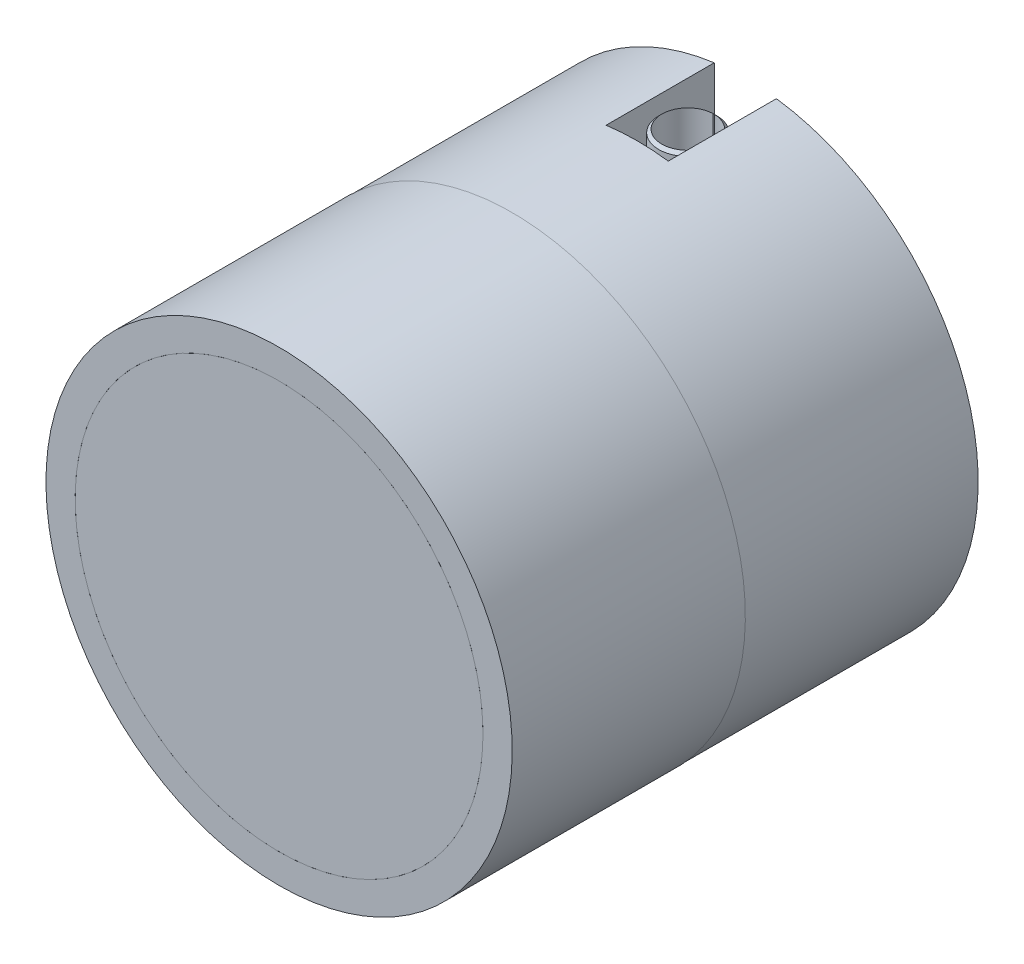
ISO-10303-21;
HEADER;
FILE_DESCRIPTION(('STEP AP214'),'2;1');
FILE_NAME('part.step','',(''),(''),'','','');
FILE_SCHEMA(('AUTOMOTIVE_DESIGN { 1 0 10303 214 1 1 1 1 }'));
ENDSEC;
DATA;
#1=APPLICATION_CONTEXT('core data for automotive mechanical design processes');
#2=APPLICATION_PROTOCOL_DEFINITION('international standard','automotive_design',2000,#1);
#3=PRODUCT_CONTEXT('',#1,'mechanical');
#4=PRODUCT('Part','Part','',(#3));
#5=PRODUCT_RELATED_PRODUCT_CATEGORY('part','',(#4));
#6=PRODUCT_DEFINITION_FORMATION('','',#4);
#7=PRODUCT_DEFINITION_CONTEXT('part definition',#1,'design');
#8=PRODUCT_DEFINITION('design','',#6,#7);
#9=PRODUCT_DEFINITION_SHAPE('','',#8);
#10=(LENGTH_UNIT() NAMED_UNIT(*) SI_UNIT(.MILLI.,.METRE.));
#11=(NAMED_UNIT(*) PLANE_ANGLE_UNIT() SI_UNIT($,.RADIAN.));
#12=(NAMED_UNIT(*) SI_UNIT($,.STERADIAN.) SOLID_ANGLE_UNIT());
#13=UNCERTAINTY_MEASURE_WITH_UNIT(LENGTH_MEASURE(1.E-05),#10,'distance_accuracy_value','');
#14=(GEOMETRIC_REPRESENTATION_CONTEXT(3) GLOBAL_UNCERTAINTY_ASSIGNED_CONTEXT((#13)) GLOBAL_UNIT_ASSIGNED_CONTEXT((#10,
#11,#12)) REPRESENTATION_CONTEXT('',''));
#15=CARTESIAN_POINT('',(0.,0.,0.));
#16=DIRECTION('',(0.,0.,1.));
#17=DIRECTION('',(1.,0.,0.));
#18=AXIS2_PLACEMENT_3D('',#15,#16,#17);
#19=CARTESIAN_POINT('',(0.,0.,0.));
#20=DIRECTION('',(0.,0.,-1.));
#21=DIRECTION('',(0.,1.,0.));
#22=AXIS2_PLACEMENT_3D('',#19,#20,#21);
#23=CYLINDRICAL_SURFACE('',#22,6.35);
#24=CARTESIAN_POINT('',(0.,0.,-8.44094090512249));
#25=DIRECTION('',(0.,0.,1.));
#26=DIRECTION('',(1.,0.,0.));
#27=AXIS2_PLACEMENT_3D('',#24,#25,#26);
#28=CIRCLE('',#27,6.35);
#29=CARTESIAN_POINT('',(6.35,0.,-8.44094090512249));
#30=VERTEX_POINT('',#29);
#31=EDGE_CURVE('P0_E246',#30,#30,#28,.T.);
#32=ORIENTED_EDGE('',*,*,#31,.T.);
#33=EDGE_LOOP('',(#32));
#34=FACE_BOUND('',#33,.T.);
#35=CARTESIAN_POINT('',(0.,0.,-9.906));
#36=DIRECTION('',(0.,0.,-1.));
#37=DIRECTION('',(0.,1.,0.));
#38=AXIS2_PLACEMENT_3D('',#35,#36,#37);
#39=CIRCLE('',#38,6.35);
#40=CARTESIAN_POINT('',(0.,6.35,-9.906));
#41=VERTEX_POINT('',#40);
#42=EDGE_CURVE('P0_E20',#41,#41,#39,.F.);
#43=ORIENTED_EDGE('',*,*,#42,.F.);
#44=EDGE_LOOP('',(#43));
#45=FACE_BOUND('',#44,.T.);
#46=ADVANCED_FACE('P0_F16',(#34,#45),#23,.F.);
#47=CARTESIAN_POINT('',(0.127000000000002,-19.05,-29.2608));
#48=DIRECTION('',(0.,0.,1.));
#49=DIRECTION('',(1.,0.,0.));
#50=AXIS2_PLACEMENT_3D('',#47,#48,#49);
#51=PLANE('',#50);
#52=DIRECTION('',(0.,1.,0.));
#53=VECTOR('',#52,1.);
#54=CARTESIAN_POINT('',(2.54,-19.05,-29.2608));
#55=LINE('',#54,#53);
#56=CARTESIAN_POINT('',(2.54,13.7371503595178,-29.2608));
#57=VERTEX_POINT('',#56);
#58=CARTESIAN_POINT('',(2.54,18.854278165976,-29.2608));
#59=VERTEX_POINT('',#58);
#60=EDGE_CURVE('P0_E135',#57,#59,#55,.T.);
#61=ORIENTED_EDGE('',*,*,#60,.F.);
#62=CARTESIAN_POINT('',(0.,0.,-29.2608));
#63=DIRECTION('',(0.,0.,1.));
#64=DIRECTION('',(1.,0.,0.));
#65=AXIS2_PLACEMENT_3D('',#62,#63,#64);
#66=CIRCLE('',#65,13.97);
#67=CARTESIAN_POINT('',(-2.54,13.7371503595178,-29.2608));
#68=VERTEX_POINT('',#67);
#69=EDGE_CURVE('P0_E87',#57,#68,#66,.T.);
#70=ORIENTED_EDGE('',*,*,#69,.T.);
#71=DIRECTION('',(0.,1.,0.));
#72=VECTOR('',#71,1.);
#73=CARTESIAN_POINT('',(-2.54,-19.05,-29.2608));
#74=LINE('',#73,#72);
#75=CARTESIAN_POINT('',(-2.54,18.854278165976,-29.2608));
#76=VERTEX_POINT('',#75);
#77=EDGE_CURVE('P0_E136',#68,#76,#74,.T.);
#78=ORIENTED_EDGE('',*,*,#77,.T.);
#79=CARTESIAN_POINT('',(0.,0.,-29.2608));
#80=DIRECTION('',(0.,0.,1.));
#81=DIRECTION('',(1.,0.,0.));
#82=AXIS2_PLACEMENT_3D('',#79,#80,#81);
#83=CIRCLE('',#82,19.0246);
#84=EDGE_CURVE('P0_E109',#59,#76,#83,.T.);
#85=ORIENTED_EDGE('',*,*,#84,.F.);
#86=EDGE_LOOP('',(#61,#70,#78,#85));
#87=FACE_BOUND('',#86,.T.);
#88=ADVANCED_FACE('P0_F181',(#87),#51,.F.);
#89=CARTESIAN_POINT('',(2.54,-19.05,-39.497));
#90=DIRECTION('',(1.,0.,0.));
#91=DIRECTION('',(0.,0.,-1.));
#92=AXIS2_PLACEMENT_3D('',#89,#90,#91);
#93=PLANE('',#92);
#94=CARTESIAN_POINT('',(2.54,-18.854278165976,-29.2608));
#95=VERTEX_POINT('',#94);
#96=CARTESIAN_POINT('',(2.54,-13.7371503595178,-29.2608));
#97=VERTEX_POINT('',#96);
#98=EDGE_CURVE('P0_E132',#95,#97,#55,.T.);
#99=ORIENTED_EDGE('',*,*,#98,.T.);
#100=DIRECTION('',(0.,0.,-1.));
#101=VECTOR('',#100,1.);
#102=CARTESIAN_POINT('',(2.54,-13.7371503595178,-9.906));
#103=LINE('',#102,#101);
#104=CARTESIAN_POINT('',(2.54,-13.7371503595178,-38.1));
#105=VERTEX_POINT('',#104);
#106=EDGE_CURVE('P0_E91',#97,#105,#103,.T.);
#107=ORIENTED_EDGE('',*,*,#106,.T.);
#108=DIRECTION('',(0.,1.,0.));
#109=VECTOR('',#108,1.);
#110=CARTESIAN_POINT('',(2.54,19.0246,-38.1));
#111=LINE('',#110,#109);
#112=CARTESIAN_POINT('',(2.54,-18.854278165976,-38.1));
#113=VERTEX_POINT('',#112);
#114=EDGE_CURVE('P0_E99',#113,#105,#111,.T.);
#115=ORIENTED_EDGE('',*,*,#114,.F.);
#116=DIRECTION('',(0.,0.,1.));
#117=VECTOR('',#116,1.);
#118=CARTESIAN_POINT('',(2.54000000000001,-18.854278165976,0.));
#119=LINE('',#118,#117);
#120=EDGE_CURVE('P0_E122',#95,#113,#119,.F.);
#121=ORIENTED_EDGE('',*,*,#120,.F.);
#122=EDGE_LOOP('',(#99,#107,#115,#121));
#123=FACE_BOUND('',#122,.T.);
#124=ADVANCED_FACE('P0_F187',(#123),#93,.F.);
#125=CARTESIAN_POINT('',(-2.54,-19.05,-31.6738));
#126=DIRECTION('',(-1.,0.,0.));
#127=DIRECTION('',(0.,0.,1.));
#128=AXIS2_PLACEMENT_3D('',#125,#126,#127);
#129=PLANE('',#128);
#130=ORIENTED_EDGE('',*,*,#77,.F.);
#131=DIRECTION('',(0.,0.,-1.));
#132=VECTOR('',#131,1.);
#133=CARTESIAN_POINT('',(-2.54,13.7371503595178,-9.906));
#134=LINE('',#133,#132);
#135=CARTESIAN_POINT('',(-2.54,13.7371503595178,-38.1));
#136=VERTEX_POINT('',#135);
#137=EDGE_CURVE('P0_E238',#68,#136,#134,.T.);
#138=ORIENTED_EDGE('',*,*,#137,.T.);
#139=DIRECTION('',(0.,-1.,0.));
#140=VECTOR('',#139,1.);
#141=CARTESIAN_POINT('',(-2.54,19.0246,-38.1));
#142=LINE('',#141,#140);
#143=CARTESIAN_POINT('',(-2.54,18.854278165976,-38.1));
#144=VERTEX_POINT('',#143);
#145=EDGE_CURVE('P0_E107',#144,#136,#142,.T.);
#146=ORIENTED_EDGE('',*,*,#145,.F.);
#147=DIRECTION('',(0.,0.,1.));
#148=VECTOR('',#147,1.);
#149=CARTESIAN_POINT('',(-2.54,18.854278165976,0.));
#150=LINE('',#149,#148);
#151=EDGE_CURVE('P0_E142',#76,#144,#150,.F.);
#152=ORIENTED_EDGE('',*,*,#151,.F.);
#153=EDGE_LOOP('',(#130,#138,#146,#152));
#154=FACE_BOUND('',#153,.T.);
#155=ADVANCED_FACE('P0_F202',(#154),#129,.F.);
#156=CARTESIAN_POINT('',(0.,19.0246,-38.1));
#157=DIRECTION('',(0.,0.,1.));
#158=DIRECTION('',(0.,-1.,0.));
#159=AXIS2_PLACEMENT_3D('',#156,#157,#158);
#160=PLANE('',#159);
#161=ORIENTED_EDGE('',*,*,#114,.T.);
#162=CARTESIAN_POINT('',(0.,0.,-38.1));
#163=DIRECTION('',(0.,0.,-1.));
#164=DIRECTION('',(0.,1.,0.));
#165=AXIS2_PLACEMENT_3D('',#162,#163,#164);
#166=CIRCLE('',#165,13.97);
#167=CARTESIAN_POINT('',(2.54,13.7371503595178,-38.1));
#168=VERTEX_POINT('',#167);
#169=EDGE_CURVE('P0_E84',#168,#105,#166,.T.);
#170=ORIENTED_EDGE('',*,*,#169,.F.);
#171=CARTESIAN_POINT('',(2.54,18.854278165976,-38.1));
#172=VERTEX_POINT('',#171);
#173=EDGE_CURVE('P0_E97',#168,#172,#111,.T.);
#174=ORIENTED_EDGE('',*,*,#173,.T.);
#175=CARTESIAN_POINT('',(0.,0.,-38.1));
#176=DIRECTION('',(0.,0.,1.));
#177=DIRECTION('',(0.,-1.,0.));
#178=AXIS2_PLACEMENT_3D('',#175,#176,#177);
#179=CIRCLE('',#178,19.0246);
#180=EDGE_CURVE('P0_E157',#113,#172,#179,.T.);
#181=ORIENTED_EDGE('',*,*,#180,.F.);
#182=EDGE_LOOP('',(#161,#170,#174,#181));
#183=FACE_BOUND('',#182,.T.);
#184=ADVANCED_FACE('P0_F95',(#183),#160,.F.);
#185=CARTESIAN_POINT('',(0.,0.,0.));
#186=DIRECTION('',(0.,0.,1.));
#187=DIRECTION('',(0.,-1.,0.));
#188=AXIS2_PLACEMENT_3D('',#185,#186,#187);
#189=CYLINDRICAL_SURFACE('',#188,19.05);
#190=CARTESIAN_POINT('',(0.,0.,0.));
#191=DIRECTION('',(0.,0.,1.));
#192=DIRECTION('',(0.,-1.,0.));
#193=AXIS2_PLACEMENT_3D('',#190,#191,#192);
#194=CIRCLE('',#193,19.05);
#195=CARTESIAN_POINT('',(0.,-19.05,0.));
#196=VERTEX_POINT('',#195);
#197=EDGE_CURVE('P0_E147',#196,#196,#194,.T.);
#198=ORIENTED_EDGE('',*,*,#197,.F.);
#199=EDGE_LOOP('',(#198));
#200=FACE_BOUND('',#199,.T.);
#201=CARTESIAN_POINT('',(0.,0.,-19.05));
#202=DIRECTION('',(0.,0.,1.));
#203=DIRECTION('',(0.,-1.,0.));
#204=AXIS2_PLACEMENT_3D('',#201,#202,#203);
#205=CIRCLE('',#204,19.05);
#206=CARTESIAN_POINT('',(0.,-19.05,-19.05));
#207=VERTEX_POINT('',#206);
#208=EDGE_CURVE('P0_E161',#207,#207,#205,.T.);
#209=ORIENTED_EDGE('',*,*,#208,.T.);
#210=EDGE_LOOP('',(#209));
#211=FACE_BOUND('',#210,.T.);
#212=ADVANCED_FACE('P0_F18',(#200,#211),#189,.T.);
#213=CARTESIAN_POINT('',(0.,19.05,-19.05));
#214=DIRECTION('',(0.,0.,1.));
#215=DIRECTION('',(0.,-1.,0.));
#216=AXIS2_PLACEMENT_3D('',#213,#214,#215);
#217=PLANE('',#216);
#218=ORIENTED_EDGE('',*,*,#208,.F.);
#219=EDGE_LOOP('',(#218));
#220=FACE_BOUND('',#219,.T.);
#221=CARTESIAN_POINT('',(0.,0.,-19.05));
#222=DIRECTION('',(0.,0.,1.));
#223=DIRECTION('',(0.,-1.,0.));
#224=AXIS2_PLACEMENT_3D('',#221,#222,#223);
#225=CIRCLE('',#224,19.0246);
#226=CARTESIAN_POINT('',(0.,-19.0246,-19.05));
#227=VERTEX_POINT('',#226);
#228=EDGE_CURVE('P0_E159',#227,#227,#225,.T.);
#229=ORIENTED_EDGE('',*,*,#228,.T.);
#230=EDGE_LOOP('',(#229));
#231=FACE_BOUND('',#230,.T.);
#232=ADVANCED_FACE('P0_F166',(#220,#231),#217,.F.);
#233=CARTESIAN_POINT('',(0.,0.,0.));
#234=DIRECTION('',(0.,0.,1.));
#235=DIRECTION('',(0.,-1.,0.));
#236=AXIS2_PLACEMENT_3D('',#233,#234,#235);
#237=CYLINDRICAL_SURFACE('',#236,19.0246);
#238=ORIENTED_EDGE('',*,*,#228,.F.);
#239=EDGE_LOOP('',(#238));
#240=FACE_BOUND('',#239,.T.);
#241=CARTESIAN_POINT('',(-2.54,-18.854278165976,-29.2608));
#242=VERTEX_POINT('',#241);
#243=EDGE_CURVE('P0_E25',#242,#95,#83,.T.);
#244=ORIENTED_EDGE('',*,*,#243,.T.);
#245=ORIENTED_EDGE('',*,*,#120,.T.);
#246=ORIENTED_EDGE('',*,*,#180,.T.);
#247=DIRECTION('',(0.,0.,1.));
#248=VECTOR('',#247,1.);
#249=CARTESIAN_POINT('',(2.54000000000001,18.854278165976,0.));
#250=LINE('',#249,#248);
#251=EDGE_CURVE('P0_E105',#172,#59,#250,.T.);
#252=ORIENTED_EDGE('',*,*,#251,.T.);
#253=ORIENTED_EDGE('',*,*,#84,.T.);
#254=ORIENTED_EDGE('',*,*,#151,.T.);
#255=CARTESIAN_POINT('',(-2.54,-18.854278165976,-38.1));
#256=VERTEX_POINT('',#255);
#257=EDGE_CURVE('P0_E156',#144,#256,#179,.T.);
#258=ORIENTED_EDGE('',*,*,#257,.T.);
#259=DIRECTION('',(0.,0.,1.));
#260=VECTOR('',#259,1.);
#261=CARTESIAN_POINT('',(-2.54,-18.854278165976,0.));
#262=LINE('',#261,#260);
#263=EDGE_CURVE('P0_E124',#256,#242,#262,.T.);
#264=ORIENTED_EDGE('',*,*,#263,.T.);
#265=EDGE_LOOP('',(#244,#245,#246,#252,#253,#254,#258,#264));
#266=FACE_BOUND('',#265,.T.);
#267=ADVANCED_FACE('P0_F121',(#240,#266),#237,.T.);
#268=ORIENTED_EDGE('',*,*,#145,.T.);
#269=CARTESIAN_POINT('',(-2.54,-13.7371503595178,-38.1));
#270=VERTEX_POINT('',#269);
#271=EDGE_CURVE('P0_E101',#270,#136,#166,.T.);
#272=ORIENTED_EDGE('',*,*,#271,.F.);
#273=EDGE_CURVE('P0_E39',#270,#256,#142,.T.);
#274=ORIENTED_EDGE('',*,*,#273,.T.);
#275=ORIENTED_EDGE('',*,*,#257,.F.);
#276=EDGE_LOOP('',(#268,#272,#274,#275));
#277=FACE_BOUND('',#276,.T.);
#278=ADVANCED_FACE('P0_F172',(#277),#160,.F.);
#279=CARTESIAN_POINT('',(0.,14.6206271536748,-7.62));
#280=DIRECTION('',(0.,0.,-1.));
#281=DIRECTION('',(0.,1.,0.));
#282=AXIS2_PLACEMENT_3D('',#279,#280,#281);
#283=PLANE('',#282);
#284=CARTESIAN_POINT('',(0.,0.,-7.62));
#285=DIRECTION('',(0.,0.,1.));
#286=DIRECTION('',(1.,0.,0.));
#287=AXIS2_PLACEMENT_3D('',#284,#285,#286);
#288=CIRCLE('',#287,7.112);
#289=CARTESIAN_POINT('',(7.112,0.,-7.62));
#290=VERTEX_POINT('',#289);
#291=EDGE_CURVE('P0_E139',#290,#290,#288,.T.);
#292=ORIENTED_EDGE('',*,*,#291,.F.);
#293=EDGE_LOOP('',(#292));
#294=FACE_BOUND('',#293,.T.);
#295=CARTESIAN_POINT('',(0.,0.,-7.62));
#296=DIRECTION('',(0.,0.,1.));
#297=DIRECTION('',(0.,-1.,0.));
#298=AXIS2_PLACEMENT_3D('',#295,#296,#297);
#299=CIRCLE('',#298,14.6206271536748);
#300=CARTESIAN_POINT('',(0.,-14.6206271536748,-7.62));
#301=VERTEX_POINT('',#300);
#302=EDGE_CURVE('P0_E153',#301,#301,#299,.T.);
#303=ORIENTED_EDGE('',*,*,#302,.T.);
#304=EDGE_LOOP('',(#303));
#305=FACE_BOUND('',#304,.T.);
#306=ADVANCED_FACE('P0_F178',(#294,#305),#283,.F.);
#307=CARTESIAN_POINT('',(0.,0.,0.));
#308=DIRECTION('',(0.,0.,1.));
#309=DIRECTION('',(0.,-1.,0.));
#310=AXIS2_PLACEMENT_3D('',#307,#308,#309);
#311=CONICAL_SURFACE('',#310,16.6624,0.26179938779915);
#312=ORIENTED_EDGE('',*,*,#302,.F.);
#313=EDGE_LOOP('',(#312));
#314=FACE_BOUND('',#313,.T.);
#315=CARTESIAN_POINT('',(0.,0.,0.));
#316=DIRECTION('',(0.,0.,1.));
#317=DIRECTION('',(0.,-1.,0.));
#318=AXIS2_PLACEMENT_3D('',#315,#316,#317);
#319=CIRCLE('',#318,16.6624);
#320=CARTESIAN_POINT('',(0.,-16.6624,0.));
#321=VERTEX_POINT('',#320);
#322=EDGE_CURVE('P0_E150',#321,#321,#319,.T.);
#323=ORIENTED_EDGE('',*,*,#322,.T.);
#324=EDGE_LOOP('',(#323));
#325=FACE_BOUND('',#324,.T.);
#326=ADVANCED_FACE('P0_F205',(#314,#325),#311,.F.);
#327=CARTESIAN_POINT('',(0.,16.6624,0.));
#328=DIRECTION('',(0.,0.,-1.));
#329=DIRECTION('',(0.,1.,0.));
#330=AXIS2_PLACEMENT_3D('',#327,#328,#329);
#331=PLANE('',#330);
#332=ORIENTED_EDGE('',*,*,#322,.F.);
#333=EDGE_LOOP('',(#332));
#334=FACE_BOUND('',#333,.T.);
#335=ORIENTED_EDGE('',*,*,#197,.T.);
#336=EDGE_LOOP('',(#335));
#337=FACE_BOUND('',#336,.T.);
#338=ADVANCED_FACE('P0_F199',(#334,#337),#331,.F.);
#339=CARTESIAN_POINT('',(-2.54,-13.7371503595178,-29.2608));
#340=VERTEX_POINT('',#339);
#341=EDGE_CURVE('P0_E130',#242,#340,#74,.T.);
#342=ORIENTED_EDGE('',*,*,#341,.T.);
#343=CARTESIAN_POINT('',(0.,0.,-29.2608));
#344=DIRECTION('',(0.,0.,1.));
#345=DIRECTION('',(1.,0.,0.));
#346=AXIS2_PLACEMENT_3D('',#343,#344,#345);
#347=CIRCLE('',#346,13.97);
#348=EDGE_CURVE('P0_E32',#340,#97,#347,.T.);
#349=ORIENTED_EDGE('',*,*,#348,.T.);
#350=ORIENTED_EDGE('',*,*,#98,.F.);
#351=ORIENTED_EDGE('',*,*,#243,.F.);
#352=EDGE_LOOP('',(#342,#349,#350,#351));
#353=FACE_BOUND('',#352,.T.);
#354=ADVANCED_FACE('P0_F129',(#353),#51,.F.);
#355=ORIENTED_EDGE('',*,*,#173,.F.);
#356=DIRECTION('',(0.,0.,-1.));
#357=VECTOR('',#356,1.);
#358=CARTESIAN_POINT('',(2.54,13.7371503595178,-9.906));
#359=LINE('',#358,#357);
#360=EDGE_CURVE('P0_E81',#168,#57,#359,.F.);
#361=ORIENTED_EDGE('',*,*,#360,.T.);
#362=ORIENTED_EDGE('',*,*,#60,.T.);
#363=ORIENTED_EDGE('',*,*,#251,.F.);
#364=EDGE_LOOP('',(#355,#361,#362,#363));
#365=FACE_BOUND('',#364,.T.);
#366=ADVANCED_FACE('P0_F103',(#365),#93,.F.);
#367=ORIENTED_EDGE('',*,*,#273,.F.);
#368=DIRECTION('',(0.,0.,-1.));
#369=VECTOR('',#368,1.);
#370=CARTESIAN_POINT('',(-2.54,-13.7371503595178,-9.906));
#371=LINE('',#370,#369);
#372=EDGE_CURVE('P0_E10',#270,#340,#371,.F.);
#373=ORIENTED_EDGE('',*,*,#372,.T.);
#374=ORIENTED_EDGE('',*,*,#341,.F.);
#375=ORIENTED_EDGE('',*,*,#263,.F.);
#376=EDGE_LOOP('',(#367,#373,#374,#375));
#377=FACE_BOUND('',#376,.T.);
#378=ADVANCED_FACE('P0_F134',(#377),#129,.F.);
#379=CARTESIAN_POINT('',(0.,0.,-8.001));
#380=DIRECTION('',(0.,0.,1.));
#381=DIRECTION('',(1.,0.,0.));
#382=AXIS2_PLACEMENT_3D('',#379,#380,#381);
#383=CYLINDRICAL_SURFACE('',#382,7.112);
#384=CARTESIAN_POINT('',(0.,0.,-8.001));
#385=DIRECTION('',(0.,0.,1.));
#386=DIRECTION('',(1.,0.,0.));
#387=AXIS2_PLACEMENT_3D('',#384,#385,#386);
#388=CIRCLE('',#387,7.112);
#389=CARTESIAN_POINT('',(7.112,0.,-8.001));
#390=VERTEX_POINT('',#389);
#391=EDGE_CURVE('P0_E243',#390,#390,#388,.T.);
#392=CARTESIAN_POINT('',(7.112,0.,-8.001));
#393=CARTESIAN_POINT('',(7.112,0.,-7.99703125));
#394=CARTESIAN_POINT('',(7.112,0.,-7.9930625));
#395=CARTESIAN_POINT('',(7.112,0.,-7.985125));
#396=CARTESIAN_POINT('',(7.112,0.,-7.98115625));
#397=CARTESIAN_POINT('',(7.112,0.,-7.97321875));
#398=CARTESIAN_POINT('',(7.112,0.,-7.96925));
#399=CARTESIAN_POINT('',(7.112,0.,-7.9613125));
#400=CARTESIAN_POINT('',(7.112,0.,-7.95734375));
#401=CARTESIAN_POINT('',(7.112,0.,-7.94940625));
#402=CARTESIAN_POINT('',(7.112,0.,-7.9454375));
#403=CARTESIAN_POINT('',(7.112,0.,-7.9375));
#404=CARTESIAN_POINT('',(7.112,0.,-7.93353125));
#405=CARTESIAN_POINT('',(7.112,0.,-7.92559375));
#406=CARTESIAN_POINT('',(7.112,0.,-7.921625));
#407=CARTESIAN_POINT('',(7.112,0.,-7.9136875));
#408=CARTESIAN_POINT('',(7.112,0.,-7.90971875));
#409=CARTESIAN_POINT('',(7.112,0.,-7.90178125));
#410=CARTESIAN_POINT('',(7.112,0.,-7.8978125));
#411=CARTESIAN_POINT('',(7.112,0.,-7.889875));
#412=CARTESIAN_POINT('',(7.112,0.,-7.88590625));
#413=CARTESIAN_POINT('',(7.112,0.,-7.87796875));
#414=CARTESIAN_POINT('',(7.112,0.,-7.874));
#415=CARTESIAN_POINT('',(7.112,0.,-7.8660625));
#416=CARTESIAN_POINT('',(7.112,0.,-7.86209375));
#417=CARTESIAN_POINT('',(7.112,0.,-7.85415625));
#418=CARTESIAN_POINT('',(7.112,0.,-7.8501875));
#419=CARTESIAN_POINT('',(7.112,0.,-7.84225));
#420=CARTESIAN_POINT('',(7.112,0.,-7.83828125));
#421=CARTESIAN_POINT('',(7.112,0.,-7.83034375));
#422=CARTESIAN_POINT('',(7.112,0.,-7.826375));
#423=CARTESIAN_POINT('',(7.112,0.,-7.8184375));
#424=CARTESIAN_POINT('',(7.112,0.,-7.81446875));
#425=CARTESIAN_POINT('',(7.112,0.,-7.80653125));
#426=CARTESIAN_POINT('',(7.112,0.,-7.8025625));
#427=CARTESIAN_POINT('',(7.112,0.,-7.794625));
#428=CARTESIAN_POINT('',(7.112,0.,-7.79065625));
#429=CARTESIAN_POINT('',(7.112,0.,-7.78271875));
#430=CARTESIAN_POINT('',(7.112,0.,-7.77875));
#431=CARTESIAN_POINT('',(7.112,0.,-7.7708125));
#432=CARTESIAN_POINT('',(7.112,0.,-7.76684375));
#433=CARTESIAN_POINT('',(7.112,0.,-7.75890625));
#434=CARTESIAN_POINT('',(7.112,0.,-7.7549375));
#435=CARTESIAN_POINT('',(7.112,0.,-7.747));
#436=CARTESIAN_POINT('',(7.112,0.,-7.74303125));
#437=CARTESIAN_POINT('',(7.112,0.,-7.73509375));
#438=CARTESIAN_POINT('',(7.112,0.,-7.731125));
#439=CARTESIAN_POINT('',(7.112,0.,-7.7231875));
#440=CARTESIAN_POINT('',(7.112,0.,-7.71921875));
#441=CARTESIAN_POINT('',(7.112,0.,-7.71128125));
#442=CARTESIAN_POINT('',(7.112,0.,-7.7073125));
#443=CARTESIAN_POINT('',(7.112,0.,-7.699375));
#444=CARTESIAN_POINT('',(7.112,0.,-7.69540625));
#445=CARTESIAN_POINT('',(7.112,0.,-7.68746875));
#446=CARTESIAN_POINT('',(7.112,0.,-7.6835));
#447=CARTESIAN_POINT('',(7.112,0.,-7.6755625));
#448=CARTESIAN_POINT('',(7.112,0.,-7.67159375));
#449=CARTESIAN_POINT('',(7.112,0.,-7.66365625));
#450=CARTESIAN_POINT('',(7.112,0.,-7.6596875));
#451=CARTESIAN_POINT('',(7.112,0.,-7.65175));
#452=CARTESIAN_POINT('',(7.112,0.,-7.64778125));
#453=CARTESIAN_POINT('',(7.112,0.,-7.63984375));
#454=CARTESIAN_POINT('',(7.112,0.,-7.635875));
#455=CARTESIAN_POINT('',(7.112,0.,-7.6279375));
#456=CARTESIAN_POINT('',(7.112,0.,-7.62396875));
#457=CARTESIAN_POINT('',(7.112,0.,-7.62));
#458=B_SPLINE_CURVE_WITH_KNOTS('',3,(#392,#393,#394,#395,#396,#397,#398,#399,#400,#401,#402,
#403,#404,#405,#406,#407,#408,#409,#410,#411,#412,#413,#414,#415,#416,#417,#418,#419,#420,#421,
#422,#423,#424,#425,#426,#427,#428,#429,#430,#431,#432,#433,#434,#435,#436,#437,#438,#439,#440,
#441,#442,#443,#444,#445,#446,#447,#448,#449,#450,#451,#452,#453,#454,#455,#456,#457),
.UNSPECIFIED.,.F.,.F.,(4,2,2,2,2,2,2,2,2,2,2,2,2,2,2,2,2,2,2,2,2,2,2,2,2,2,2,2,2,2,2,2,4),(0.,
0.0119062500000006,0.0238125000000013,0.0357187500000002,0.0476250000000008,0.0595312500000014,
0.0714375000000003,0.083343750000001,0.0952500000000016,0.10715625,0.119062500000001,
0.130968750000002,0.142875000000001,0.154781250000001,0.166687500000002,0.178593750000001,
0.190500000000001,0.202406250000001,0.214312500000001,0.226218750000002,0.238125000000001,
0.250031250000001,0.261937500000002,0.273843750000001,0.285750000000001,0.297656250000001,
0.309562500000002,0.321468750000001,0.333375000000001,0.345281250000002,0.357187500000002,
0.369093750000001,0.381000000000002),.UNSPECIFIED.);
#459=EDGE_CURVE('P0_BSEAM194',#390,#290,#458,.T.);
#460=ORIENTED_EDGE('',*,*,#391,.F.);
#461=ORIENTED_EDGE('',*,*,#291,.T.);
#462=ORIENTED_EDGE('',*,*,#459,.T.);
#463=ORIENTED_EDGE('',*,*,#459,.F.);
#464=EDGE_LOOP('',(#460,#462,#461,#463));
#465=FACE_BOUND('',#464,.T.);
#466=ADVANCED_FACE('P0_F194',(#465),#383,.F.);
#467=CARTESIAN_POINT('',(0.,0.,-8.001));
#468=DIRECTION('',(0.,0.,1.));
#469=DIRECTION('',(1.,0.,0.));
#470=AXIS2_PLACEMENT_3D('',#467,#468,#469);
#471=CONICAL_SURFACE('',#470,7.112,1.0471975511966);
#472=ORIENTED_EDGE('',*,*,#391,.T.);
#473=EDGE_LOOP('',(#472));
#474=FACE_BOUND('',#473,.T.);
#475=ORIENTED_EDGE('',*,*,#31,.F.);
#476=EDGE_LOOP('',(#475));
#477=FACE_BOUND('',#476,.T.);
#478=ADVANCED_FACE('P0_F249',(#474,#477),#471,.F.);
#479=CARTESIAN_POINT('',(0.,0.,-9.906));
#480=DIRECTION('',(0.,0.,-1.));
#481=DIRECTION('',(0.,1.,0.));
#482=AXIS2_PLACEMENT_3D('',#479,#480,#481);
#483=PLANE('',#482);
#484=CARTESIAN_POINT('',(0.,0.,-9.906));
#485=DIRECTION('',(0.,0.,-1.));
#486=DIRECTION('',(0.,1.,0.));
#487=AXIS2_PLACEMENT_3D('',#484,#485,#486);
#488=CIRCLE('',#487,13.97);
#489=CARTESIAN_POINT('',(0.,13.97,-9.906));
#490=VERTEX_POINT('',#489);
#491=EDGE_CURVE('P0_E100',#490,#490,#488,.T.);
#492=ORIENTED_EDGE('',*,*,#491,.T.);
#493=EDGE_LOOP('',(#492));
#494=FACE_BOUND('',#493,.T.);
#495=ORIENTED_EDGE('',*,*,#42,.T.);
#496=EDGE_LOOP('',(#495));
#497=FACE_BOUND('',#496,.T.);
#498=ADVANCED_FACE('P0_F254',(#494,#497),#483,.T.);
#499=CARTESIAN_POINT('',(0.,0.,-9.906));
#500=DIRECTION('',(0.,0.,-1.));
#501=DIRECTION('',(0.,1.,0.));
#502=AXIS2_PLACEMENT_3D('',#499,#500,#501);
#503=CYLINDRICAL_SURFACE('',#502,13.97);
#504=ORIENTED_EDGE('',*,*,#491,.F.);
#505=EDGE_LOOP('',(#504));
#506=FACE_BOUND('',#505,.T.);
#507=ORIENTED_EDGE('',*,*,#69,.F.);
#508=ORIENTED_EDGE('',*,*,#360,.F.);
#509=ORIENTED_EDGE('',*,*,#169,.T.);
#510=ORIENTED_EDGE('',*,*,#106,.F.);
#511=ORIENTED_EDGE('',*,*,#348,.F.);
#512=ORIENTED_EDGE('',*,*,#372,.F.);
#513=ORIENTED_EDGE('',*,*,#271,.T.);
#514=ORIENTED_EDGE('',*,*,#137,.F.);
#515=EDGE_LOOP('',(#507,#508,#509,#510,#511,#512,#513,#514));
#516=FACE_BOUND('',#515,.T.);
#517=ADVANCED_FACE('P0_F83',(#506,#516),#503,.F.);
#518=CLOSED_SHELL('',(#46,#88,#124,#155,#184,#212,#232,#267,#278,#306,#326,#338,#354,#366,#378,
#466,#478,#498,#517));
#519=MANIFOLD_SOLID_BREP('P0_B1',#518);
#520=CARTESIAN_POINT('',(0.,17.78,-33.401));
#521=DIRECTION('',(0.,-1.,0.));
#522=DIRECTION('',(-1.,0.,0.));
#523=AXIS2_PLACEMENT_3D('',#520,#521,#522);
#524=CYLINDRICAL_SURFACE('',#523,2.38125);
#525=DIRECTION('',(0.,-1.,0.));
#526=VECTOR('',#525,1.);
#527=CARTESIAN_POINT('',(-0.0635,17.78,-35.7814031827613));
#528=LINE('',#527,#526);
#529=CARTESIAN_POINT('',(-0.0635,17.526,-35.7814031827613));
#530=VERTEX_POINT('',#529);
#531=CARTESIAN_POINT('',(-0.0635,-17.526,-35.7814031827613));
#532=VERTEX_POINT('',#531);
#533=EDGE_CURVE('P1_E83',#530,#532,#528,.T.);
#534=ORIENTED_EDGE('',*,*,#533,.T.);
#535=CARTESIAN_POINT('',(0.,-17.526,-33.401));
#536=DIRECTION('',(0.,1.,0.));
#537=DIRECTION('',(1.,0.,0.));
#538=AXIS2_PLACEMENT_3D('',#535,#536,#537);
#539=CIRCLE('',#538,2.38125);
#540=CARTESIAN_POINT('',(0.0635,-17.526,-35.7814031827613));
#541=VERTEX_POINT('',#540);
#542=EDGE_CURVE('P1_E71',#532,#541,#539,.T.);
#543=ORIENTED_EDGE('',*,*,#542,.T.);
#544=DIRECTION('',(0.,-1.,0.));
#545=VECTOR('',#544,1.);
#546=CARTESIAN_POINT('',(0.0635,17.78,-35.7814031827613));
#547=LINE('',#546,#545);
#548=CARTESIAN_POINT('',(0.0635,17.526,-35.7814031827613));
#549=VERTEX_POINT('',#548);
#550=EDGE_CURVE('P1_E78',#549,#541,#547,.T.);
#551=ORIENTED_EDGE('',*,*,#550,.F.);
#552=CARTESIAN_POINT('',(0.,17.526,-33.401));
#553=DIRECTION('',(0.,1.,0.));
#554=DIRECTION('',(1.,0.,0.));
#555=AXIS2_PLACEMENT_3D('',#552,#553,#554);
#556=CIRCLE('',#555,2.38125);
#557=EDGE_CURVE('P1_E43',#549,#530,#556,.F.);
#558=ORIENTED_EDGE('',*,*,#557,.T.);
#559=EDGE_LOOP('',(#534,#543,#551,#558));
#560=FACE_BOUND('',#559,.T.);
#561=ADVANCED_FACE('P1_F17',(#560),#524,.T.);
#562=CARTESIAN_POINT('',(0.0635,17.78,-35.7814031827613));
#563=DIRECTION('',(1.,0.,0.));
#564=DIRECTION('',(0.,0.,-1.));
#565=AXIS2_PLACEMENT_3D('',#562,#563,#564);
#566=PLANE('',#565);
#567=ORIENTED_EDGE('',*,*,#550,.T.);
#568=CARTESIAN_POINT('',(0.0635,-17.526,-35.7814031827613));
#569=CARTESIAN_POINT('',(0.0635,-17.5683342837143,-35.7390539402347));
#570=CARTESIAN_POINT('',(0.0635,-17.610668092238,-35.6967042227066));
#571=CARTESIAN_POINT('',(0.0635000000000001,-17.6953347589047,-35.6120038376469));
#572=CARTESIAN_POINT('',(0.0635000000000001,-17.7376676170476,-35.5696531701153));
#573=CARTESIAN_POINT('',(0.0635000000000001,-17.78,-35.5273020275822));
#574=B_SPLINE_CURVE_WITH_KNOTS('',3,(#568,#569,#570,#571,#572,#573),.UNSPECIFIED.,.F.,.F.,(4,2,
4),(0.,0.179640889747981,0.359281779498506),.UNSPECIFIED.);
#575=CARTESIAN_POINT('',(0.0635000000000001,-17.78,-35.5273020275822));
#576=VERTEX_POINT('',#575);
#577=EDGE_CURVE('P1_E70',#541,#576,#574,.T.);
#578=ORIENTED_EDGE('',*,*,#577,.T.);
#579=DIRECTION('',(0.,-1.,0.));
#580=VECTOR('',#579,1.);
#581=CARTESIAN_POINT('',(0.0635000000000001,17.78,-35.5273020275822));
#582=LINE('',#581,#580);
#583=CARTESIAN_POINT('',(0.0635000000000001,17.78,-35.5273020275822));
#584=VERTEX_POINT('',#583);
#585=EDGE_CURVE('P1_E74',#584,#576,#582,.T.);
#586=ORIENTED_EDGE('',*,*,#585,.F.);
#587=CARTESIAN_POINT('',(0.0635000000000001,17.78,-35.5273020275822));
#588=CARTESIAN_POINT('',(0.0635000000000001,17.7376676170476,-35.5696531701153));
#589=CARTESIAN_POINT('',(0.0635000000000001,17.6953347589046,-35.6120038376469));
#590=CARTESIAN_POINT('',(0.0635,17.610668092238,-35.6967042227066));
#591=CARTESIAN_POINT('',(0.0635,17.5683342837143,-35.7390539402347));
#592=CARTESIAN_POINT('',(0.0635,17.526,-35.7814031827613));
#593=B_SPLINE_CURVE_WITH_KNOTS('',3,(#587,#588,#589,#590,#591,#592),.UNSPECIFIED.,.F.,.F.,(4,2,
4),(0.,0.179640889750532,0.359281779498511),.UNSPECIFIED.);
#594=EDGE_CURVE('P1_E63',#584,#549,#593,.T.);
#595=ORIENTED_EDGE('',*,*,#594,.T.);
#596=EDGE_LOOP('',(#567,#578,#586,#595));
#597=FACE_BOUND('',#596,.T.);
#598=ADVANCED_FACE('P1_F75',(#597),#566,.F.);
#599=CARTESIAN_POINT('',(0.,17.78,-33.401));
#600=DIRECTION('',(0.,-1.,0.));
#601=DIRECTION('',(-1.,0.,0.));
#602=AXIS2_PLACEMENT_3D('',#599,#600,#601);
#603=CYLINDRICAL_SURFACE('',#602,2.12725);
#604=CARTESIAN_POINT('',(0.,-17.78,-33.401));
#605=DIRECTION('',(0.,-1.,0.));
#606=DIRECTION('',(1.,0.,0.));
#607=AXIS2_PLACEMENT_3D('',#604,#605,#606);
#608=CIRCLE('',#607,2.12725);
#609=CARTESIAN_POINT('',(-0.0635,-17.78,-35.5273020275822));
#610=VERTEX_POINT('',#609);
#611=EDGE_CURVE('P1_E84',#576,#610,#608,.T.);
#612=ORIENTED_EDGE('',*,*,#611,.T.);
#613=DIRECTION('',(0.,-1.,0.));
#614=VECTOR('',#613,1.);
#615=CARTESIAN_POINT('',(-0.0635,17.78,-35.5273020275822));
#616=LINE('',#615,#614);
#617=CARTESIAN_POINT('',(-0.0635,17.78,-35.5273020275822));
#618=VERTEX_POINT('',#617);
#619=EDGE_CURVE('P1_E79',#618,#610,#616,.T.);
#620=ORIENTED_EDGE('',*,*,#619,.F.);
#621=CARTESIAN_POINT('',(0.,17.78,-33.401));
#622=DIRECTION('',(0.,-1.,0.));
#623=DIRECTION('',(1.,0.,0.));
#624=AXIS2_PLACEMENT_3D('',#621,#622,#623);
#625=CIRCLE('',#624,2.12725);
#626=EDGE_CURVE('P1_E67',#584,#618,#625,.T.);
#627=ORIENTED_EDGE('',*,*,#626,.F.);
#628=ORIENTED_EDGE('',*,*,#585,.T.);
#629=EDGE_LOOP('',(#612,#620,#627,#628));
#630=FACE_BOUND('',#629,.T.);
#631=ADVANCED_FACE('P1_F82',(#630),#603,.F.);
#632=CARTESIAN_POINT('',(-0.0635,17.78,-35.7814031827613));
#633=DIRECTION('',(-1.,0.,0.));
#634=DIRECTION('',(0.,0.,1.));
#635=AXIS2_PLACEMENT_3D('',#632,#633,#634);
#636=PLANE('',#635);
#637=ORIENTED_EDGE('',*,*,#619,.T.);
#638=CARTESIAN_POINT('',(-0.0635000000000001,-17.78,-35.5273020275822));
#639=CARTESIAN_POINT('',(-0.0635000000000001,-17.7376676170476,-35.5696531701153));
#640=CARTESIAN_POINT('',(-0.0635,-17.6953347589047,-35.6120038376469));
#641=CARTESIAN_POINT('',(-0.0635,-17.610668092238,-35.6967042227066));
#642=CARTESIAN_POINT('',(-0.0635,-17.5683342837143,-35.7390539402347));
#643=CARTESIAN_POINT('',(-0.0635,-17.526,-35.7814031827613));
#644=B_SPLINE_CURVE_WITH_KNOTS('',3,(#638,#639,#640,#641,#642,#643),.UNSPECIFIED.,.F.,.F.,(4,2,
4),(0.,0.179640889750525,0.359281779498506),.UNSPECIFIED.);
#645=EDGE_CURVE('P1_E11',#610,#532,#644,.T.);
#646=ORIENTED_EDGE('',*,*,#645,.T.);
#647=ORIENTED_EDGE('',*,*,#533,.F.);
#648=CARTESIAN_POINT('',(-0.0635,17.526,-35.7814031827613));
#649=CARTESIAN_POINT('',(-0.0635,17.5683342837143,-35.7390539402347));
#650=CARTESIAN_POINT('',(-0.0635,17.610668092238,-35.6967042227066));
#651=CARTESIAN_POINT('',(-0.0635000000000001,17.6953347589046,-35.6120038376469));
#652=CARTESIAN_POINT('',(-0.0635000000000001,17.7376676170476,-35.5696531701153));
#653=CARTESIAN_POINT('',(-0.0635000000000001,17.78,-35.5273020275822));
#654=B_SPLINE_CURVE_WITH_KNOTS('',3,(#648,#649,#650,#651,#652,#653),.UNSPECIFIED.,.F.,.F.,(4,2,
4),(0.,0.179640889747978,0.359281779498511),.UNSPECIFIED.);
#655=EDGE_CURVE('P1_E31',#530,#618,#654,.T.);
#656=ORIENTED_EDGE('',*,*,#655,.T.);
#657=EDGE_LOOP('',(#637,#646,#647,#656));
#658=FACE_BOUND('',#657,.T.);
#659=ADVANCED_FACE('P1_F112',(#658),#636,.F.);
#660=CARTESIAN_POINT('',(0.,-17.526,-33.401));
#661=DIRECTION('',(0.,1.,0.));
#662=DIRECTION('',(1.,0.,0.));
#663=AXIS2_PLACEMENT_3D('',#660,#661,#662);
#664=CONICAL_SURFACE('',#663,2.38125,0.785398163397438);
#665=ORIENTED_EDGE('',*,*,#645,.F.);
#666=ORIENTED_EDGE('',*,*,#611,.F.);
#667=ORIENTED_EDGE('',*,*,#577,.F.);
#668=ORIENTED_EDGE('',*,*,#542,.F.);
#669=EDGE_LOOP('',(#665,#666,#667,#668));
#670=FACE_BOUND('',#669,.T.);
#671=ADVANCED_FACE('P1_F109',(#670),#664,.T.);
#672=CARTESIAN_POINT('',(0.,17.78,-33.401));
#673=DIRECTION('',(0.,-1.,0.));
#674=DIRECTION('',(-1.,0.,0.));
#675=AXIS2_PLACEMENT_3D('',#672,#673,#674);
#676=CONICAL_SURFACE('',#675,2.12724999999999,0.785398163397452);
#677=ORIENTED_EDGE('',*,*,#655,.F.);
#678=ORIENTED_EDGE('',*,*,#557,.F.);
#679=ORIENTED_EDGE('',*,*,#594,.F.);
#680=ORIENTED_EDGE('',*,*,#626,.T.);
#681=EDGE_LOOP('',(#677,#678,#679,#680));
#682=FACE_BOUND('',#681,.T.);
#683=ADVANCED_FACE('P1_F19',(#682),#676,.T.);
#684=CLOSED_SHELL('',(#561,#598,#631,#659,#671,#683));
#685=MANIFOLD_SOLID_BREP('P1_B1',#684);
#686=CARTESIAN_POINT('',(12.7,0.,-29.4513));
#687=DIRECTION('',(0.,1.,0.));
#688=DIRECTION('',(0.,0.,1.));
#689=AXIS2_PLACEMENT_3D('',#686,#687,#688);
#690=PLANE('',#689);
#691=CARTESIAN_POINT('',(12.7,0.,-29.4513));
#692=DIRECTION('',(0.,1.,0.));
#693=DIRECTION('',(0.,0.,1.));
#694=AXIS2_PLACEMENT_3D('',#691,#692,#693);
#695=CIRCLE('',#694,1.143);
#696=CARTESIAN_POINT('',(12.7,0.,-28.3083));
#697=VERTEX_POINT('',#696);
#698=EDGE_CURVE('P2_E24',#697,#697,#695,.T.);
#699=ORIENTED_EDGE('',*,*,#698,.T.);
#700=EDGE_LOOP('',(#699));
#701=FACE_BOUND('',#700,.T.);
#702=ADVANCED_FACE('P2_F17',(#701),#690,.T.);
#703=CARTESIAN_POINT('',(-12.7,6.21184676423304E-13,-11.049));
#704=DIRECTION('',(0.,-1.,0.));
#705=DIRECTION('',(0.,0.,1.));
#706=AXIS2_PLACEMENT_3D('',#703,#704,#705);
#707=PLANE('',#706);
#708=CARTESIAN_POINT('',(-12.7,6.21184676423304E-13,-11.049));
#709=DIRECTION('',(0.,-1.,0.));
#710=DIRECTION('',(0.,0.,1.));
#711=AXIS2_PLACEMENT_3D('',#708,#709,#710);
#712=CIRCLE('',#711,1.143);
#713=CARTESIAN_POINT('',(-12.7,6.21184676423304E-13,-9.906));
#714=VERTEX_POINT('',#713);
#715=EDGE_CURVE('P2_E11',#714,#714,#712,.T.);
#716=ORIENTED_EDGE('',*,*,#715,.F.);
#717=EDGE_LOOP('',(#716));
#718=FACE_BOUND('',#717,.T.);
#719=ADVANCED_FACE('P2_F33',(#718),#707,.F.);
#720=CARTESIAN_POINT('',(12.7,0.,-28.3083));
#721=CARTESIAN_POINT('',(12.7,-7.33234841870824,-27.87015));
#722=CARTESIAN_POINT('',(6.35,-10.9985226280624,-27.432));
#723=CARTESIAN_POINT('',(0.,-14.6646968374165,-26.99385));
#724=CARTESIAN_POINT('',(-6.35,-10.9985226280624,-26.5557));
#725=CARTESIAN_POINT('',(-12.7,-7.33234841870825,-26.11755));
#726=CARTESIAN_POINT('',(-12.7,0.,-25.6794));
#727=CARTESIAN_POINT('',(-12.7,7.33234841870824,-25.24125));
#728=CARTESIAN_POINT('',(-6.35000000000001,10.9985226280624,-24.8031));
#729=CARTESIAN_POINT('',(0.,14.6646968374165,-24.36495));
#730=CARTESIAN_POINT('',(6.34999999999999,10.9985226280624,-23.9268));
#731=CARTESIAN_POINT('',(12.7,7.33234841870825,-23.48865));
#732=CARTESIAN_POINT('',(12.7,0.,-23.0505));
#733=CARTESIAN_POINT('',(12.7,-7.33234841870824,-22.61235));
#734=CARTESIAN_POINT('',(6.35,-10.9985226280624,-22.1742));
#735=CARTESIAN_POINT('',(0.,-14.6646968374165,-21.73605));
#736=CARTESIAN_POINT('',(-6.35,-10.9985226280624,-21.2979));
#737=CARTESIAN_POINT('',(-12.7,-7.33234841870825,-20.85975));
#738=CARTESIAN_POINT('',(-12.7,0.,-20.4216));
#739=CARTESIAN_POINT('',(-12.7,7.33234841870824,-19.98345));
#740=CARTESIAN_POINT('',(-6.35000000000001,10.9985226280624,-19.5453));
#741=CARTESIAN_POINT('',(0.,14.6646968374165,-19.10715));
#742=CARTESIAN_POINT('',(6.34999999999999,10.9985226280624,-18.669));
#743=CARTESIAN_POINT('',(12.7,7.33234841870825,-18.23085));
#744=CARTESIAN_POINT('',(12.7,0.,-17.7927));
#745=CARTESIAN_POINT('',(12.7,-7.33234841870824,-17.35455));
#746=CARTESIAN_POINT('',(6.35,-10.9985226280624,-16.9164));
#747=CARTESIAN_POINT('',(0.,-14.6646968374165,-16.47825));
#748=CARTESIAN_POINT('',(-6.35,-10.9985226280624,-16.0401));
#749=CARTESIAN_POINT('',(-12.7,-7.33234841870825,-15.60195));
#750=CARTESIAN_POINT('',(-12.7,0.,-15.1638));
#751=CARTESIAN_POINT('',(-12.7,7.33234841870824,-14.72565));
#752=CARTESIAN_POINT('',(-6.35000000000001,10.9985226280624,-14.2875));
#753=CARTESIAN_POINT('',(0.,14.6646968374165,-13.84935));
#754=CARTESIAN_POINT('',(6.34999999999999,10.9985226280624,-13.4112));
#755=CARTESIAN_POINT('',(12.7,7.33234841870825,-12.97305));
#756=CARTESIAN_POINT('',(12.7,0.,-12.5349));
#757=CARTESIAN_POINT('',(12.7,-7.33234841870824,-12.09675));
#758=CARTESIAN_POINT('',(6.35,-10.9985226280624,-11.6586));
#759=CARTESIAN_POINT('',(0.,-14.6646968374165,-11.22045));
#760=CARTESIAN_POINT('',(-6.35,-10.9985226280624,-10.7823));
#761=CARTESIAN_POINT('',(-12.7,-7.33234841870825,-10.34415));
#762=CARTESIAN_POINT('',(-12.7,0.,-9.90600000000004));
#763=CARTESIAN_POINT('',(-12.7,7.33234841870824,-9.46785000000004));
#764=CARTESIAN_POINT('',(-6.35000000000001,10.9985226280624,-9.02970000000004));
#765=CARTESIAN_POINT('',(0.,14.6646968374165,-8.59155000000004));
#766=CARTESIAN_POINT('',(6.34999999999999,10.9985226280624,-8.15340000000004));
#767=CARTESIAN_POINT('',(12.7,7.33234841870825,-7.71525000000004));
#768=CARTESIAN_POINT('',(12.7,0.,-7.27710000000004));
#769=CARTESIAN_POINT('',(14.986,0.,-28.3083));
#770=CARTESIAN_POINT('',(14.986,-8.65217113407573,-27.87015));
#771=CARTESIAN_POINT('',(7.493,-12.9782567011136,-27.432));
#772=CARTESIAN_POINT('',(0.,-17.3043422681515,-26.99385));
#773=CARTESIAN_POINT('',(-7.493,-12.9782567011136,-26.5557));
#774=CARTESIAN_POINT('',(-14.986,-8.65217113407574,-26.11755));
#775=CARTESIAN_POINT('',(-14.986,0.,-25.6794));
#776=CARTESIAN_POINT('',(-14.986,8.65217113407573,-25.24125));
#777=CARTESIAN_POINT('',(-7.49300000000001,12.9782567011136,-24.8031));
#778=CARTESIAN_POINT('',(0.,17.3043422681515,-24.36495));
#779=CARTESIAN_POINT('',(7.49299999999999,12.9782567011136,-23.9268));
#780=CARTESIAN_POINT('',(14.986,8.65217113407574,-23.48865));
#781=CARTESIAN_POINT('',(14.986,0.,-23.0505));
#782=CARTESIAN_POINT('',(14.986,-8.65217113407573,-22.61235));
#783=CARTESIAN_POINT('',(7.493,-12.9782567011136,-22.1742));
#784=CARTESIAN_POINT('',(0.,-17.3043422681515,-21.73605));
#785=CARTESIAN_POINT('',(-7.493,-12.9782567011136,-21.2979));
#786=CARTESIAN_POINT('',(-14.986,-8.65217113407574,-20.85975));
#787=CARTESIAN_POINT('',(-14.986,0.,-20.4216));
#788=CARTESIAN_POINT('',(-14.986,8.65217113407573,-19.98345));
#789=CARTESIAN_POINT('',(-7.49300000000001,12.9782567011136,-19.5453));
#790=CARTESIAN_POINT('',(0.,17.3043422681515,-19.10715));
#791=CARTESIAN_POINT('',(7.49299999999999,12.9782567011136,-18.669));
#792=CARTESIAN_POINT('',(14.986,8.65217113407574,-18.23085));
#793=CARTESIAN_POINT('',(14.986,0.,-17.7927));
#794=CARTESIAN_POINT('',(14.986,-8.65217113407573,-17.35455));
#795=CARTESIAN_POINT('',(7.493,-12.9782567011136,-16.9164));
#796=CARTESIAN_POINT('',(0.,-17.3043422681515,-16.47825));
#797=CARTESIAN_POINT('',(-7.493,-12.9782567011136,-16.0401));
#798=CARTESIAN_POINT('',(-14.986,-8.65217113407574,-15.60195));
#799=CARTESIAN_POINT('',(-14.986,0.,-15.1638));
#800=CARTESIAN_POINT('',(-14.986,8.65217113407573,-14.72565));
#801=CARTESIAN_POINT('',(-7.49300000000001,12.9782567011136,-14.2875));
#802=CARTESIAN_POINT('',(0.,17.3043422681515,-13.84935));
#803=CARTESIAN_POINT('',(7.49299999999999,12.9782567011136,-13.4112));
#804=CARTESIAN_POINT('',(14.986,8.65217113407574,-12.97305));
#805=CARTESIAN_POINT('',(14.986,0.,-12.5349));
#806=CARTESIAN_POINT('',(14.986,-8.65217113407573,-12.09675));
#807=CARTESIAN_POINT('',(7.493,-12.9782567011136,-11.6586));
#808=CARTESIAN_POINT('',(0.,-17.3043422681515,-11.22045));
#809=CARTESIAN_POINT('',(-7.493,-12.9782567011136,-10.7823));
#810=CARTESIAN_POINT('',(-14.986,-8.65217113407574,-10.34415));
#811=CARTESIAN_POINT('',(-14.986,0.,-9.90600000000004));
#812=CARTESIAN_POINT('',(-14.986,8.65217113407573,-9.46785000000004));
#813=CARTESIAN_POINT('',(-7.49300000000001,12.9782567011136,-9.02970000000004));
#814=CARTESIAN_POINT('',(0.,17.3043422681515,-8.59155000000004));
#815=CARTESIAN_POINT('',(7.49299999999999,12.9782567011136,-8.15340000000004));
#816=CARTESIAN_POINT('',(14.986,8.65217113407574,-7.71525000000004));
#817=CARTESIAN_POINT('',(14.986,0.,-7.27710000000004));
#818=CARTESIAN_POINT('',(14.986,0.,-30.5943));
#819=CARTESIAN_POINT('',(14.986,-8.65217113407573,-30.15615));
#820=CARTESIAN_POINT('',(7.493,-12.9782567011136,-29.718));
#821=CARTESIAN_POINT('',(0.,-17.3043422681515,-29.27985));
#822=CARTESIAN_POINT('',(-7.493,-12.9782567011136,-28.8417));
#823=CARTESIAN_POINT('',(-14.986,-8.65217113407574,-28.40355));
#824=CARTESIAN_POINT('',(-14.986,0.,-27.9654));
#825=CARTESIAN_POINT('',(-14.986,8.65217113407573,-27.52725));
#826=CARTESIAN_POINT('',(-7.49300000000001,12.9782567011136,-27.0891));
#827=CARTESIAN_POINT('',(0.,17.3043422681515,-26.65095));
#828=CARTESIAN_POINT('',(7.49299999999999,12.9782567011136,-26.2128));
#829=CARTESIAN_POINT('',(14.986,8.65217113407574,-25.77465));
#830=CARTESIAN_POINT('',(14.986,0.,-25.3365));
#831=CARTESIAN_POINT('',(14.986,-8.65217113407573,-24.89835));
#832=CARTESIAN_POINT('',(7.493,-12.9782567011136,-24.4602));
#833=CARTESIAN_POINT('',(0.,-17.3043422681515,-24.02205));
#834=CARTESIAN_POINT('',(-7.493,-12.9782567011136,-23.5839));
#835=CARTESIAN_POINT('',(-14.986,-8.65217113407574,-23.14575));
#836=CARTESIAN_POINT('',(-14.986,0.,-22.7076));
#837=CARTESIAN_POINT('',(-14.986,8.65217113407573,-22.26945));
#838=CARTESIAN_POINT('',(-7.49300000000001,12.9782567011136,-21.8313));
#839=CARTESIAN_POINT('',(0.,17.3043422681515,-21.39315));
#840=CARTESIAN_POINT('',(7.49299999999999,12.9782567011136,-20.955));
#841=CARTESIAN_POINT('',(14.986,8.65217113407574,-20.51685));
#842=CARTESIAN_POINT('',(14.986,0.,-20.0787));
#843=CARTESIAN_POINT('',(14.986,-8.65217113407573,-19.64055));
#844=CARTESIAN_POINT('',(7.493,-12.9782567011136,-19.2024));
#845=CARTESIAN_POINT('',(0.,-17.3043422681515,-18.76425));
#846=CARTESIAN_POINT('',(-7.493,-12.9782567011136,-18.3261));
#847=CARTESIAN_POINT('',(-14.986,-8.65217113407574,-17.88795));
#848=CARTESIAN_POINT('',(-14.986,0.,-17.4498));
#849=CARTESIAN_POINT('',(-14.986,8.65217113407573,-17.01165));
#850=CARTESIAN_POINT('',(-7.49300000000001,12.9782567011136,-16.5735));
#851=CARTESIAN_POINT('',(0.,17.3043422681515,-16.13535));
#852=CARTESIAN_POINT('',(7.49299999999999,12.9782567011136,-15.6972));
#853=CARTESIAN_POINT('',(14.986,8.65217113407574,-15.25905));
#854=CARTESIAN_POINT('',(14.986,0.,-14.8209));
#855=CARTESIAN_POINT('',(14.986,-8.65217113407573,-14.38275));
#856=CARTESIAN_POINT('',(7.493,-12.9782567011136,-13.9446));
#857=CARTESIAN_POINT('',(0.,-17.3043422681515,-13.50645));
#858=CARTESIAN_POINT('',(-7.493,-12.9782567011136,-13.0683));
#859=CARTESIAN_POINT('',(-14.986,-8.65217113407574,-12.63015));
#860=CARTESIAN_POINT('',(-14.986,0.,-12.192));
#861=CARTESIAN_POINT('',(-14.986,8.65217113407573,-11.75385));
#862=CARTESIAN_POINT('',(-7.49300000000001,12.9782567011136,-11.3157));
#863=CARTESIAN_POINT('',(0.,17.3043422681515,-10.87755));
#864=CARTESIAN_POINT('',(7.49299999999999,12.9782567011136,-10.4394));
#865=CARTESIAN_POINT('',(14.986,8.65217113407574,-10.00125));
#866=CARTESIAN_POINT('',(14.986,0.,-9.56310000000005));
#867=CARTESIAN_POINT('',(12.7,0.,-30.5943));
#868=CARTESIAN_POINT('',(12.7,-7.33234841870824,-30.15615));
#869=CARTESIAN_POINT('',(6.35,-10.9985226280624,-29.718));
#870=CARTESIAN_POINT('',(0.,-14.6646968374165,-29.27985));
#871=CARTESIAN_POINT('',(-6.35,-10.9985226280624,-28.8417));
#872=CARTESIAN_POINT('',(-12.7,-7.33234841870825,-28.40355));
#873=CARTESIAN_POINT('',(-12.7,0.,-27.9654));
#874=CARTESIAN_POINT('',(-12.7,7.33234841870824,-27.52725));
#875=CARTESIAN_POINT('',(-6.35000000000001,10.9985226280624,-27.0891));
#876=CARTESIAN_POINT('',(0.,14.6646968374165,-26.65095));
#877=CARTESIAN_POINT('',(6.34999999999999,10.9985226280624,-26.2128));
#878=CARTESIAN_POINT('',(12.7,7.33234841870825,-25.77465));
#879=CARTESIAN_POINT('',(12.7,0.,-25.3365));
#880=CARTESIAN_POINT('',(12.7,-7.33234841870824,-24.89835));
#881=CARTESIAN_POINT('',(6.35,-10.9985226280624,-24.4602));
#882=CARTESIAN_POINT('',(0.,-14.6646968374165,-24.02205));
#883=CARTESIAN_POINT('',(-6.35,-10.9985226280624,-23.5839));
#884=CARTESIAN_POINT('',(-12.7,-7.33234841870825,-23.14575));
#885=CARTESIAN_POINT('',(-12.7,0.,-22.7076));
#886=CARTESIAN_POINT('',(-12.7,7.33234841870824,-22.26945));
#887=CARTESIAN_POINT('',(-6.35000000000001,10.9985226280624,-21.8313));
#888=CARTESIAN_POINT('',(0.,14.6646968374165,-21.39315));
#889=CARTESIAN_POINT('',(6.34999999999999,10.9985226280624,-20.955));
#890=CARTESIAN_POINT('',(12.7,7.33234841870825,-20.51685));
#891=CARTESIAN_POINT('',(12.7,0.,-20.0787));
#892=CARTESIAN_POINT('',(12.7,-7.33234841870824,-19.64055));
#893=CARTESIAN_POINT('',(6.35,-10.9985226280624,-19.2024));
#894=CARTESIAN_POINT('',(0.,-14.6646968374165,-18.76425));
#895=CARTESIAN_POINT('',(-6.35,-10.9985226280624,-18.3261));
#896=CARTESIAN_POINT('',(-12.7,-7.33234841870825,-17.88795));
#897=CARTESIAN_POINT('',(-12.7,0.,-17.4498));
#898=CARTESIAN_POINT('',(-12.7,7.33234841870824,-17.01165));
#899=CARTESIAN_POINT('',(-6.35000000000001,10.9985226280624,-16.5735));
#900=CARTESIAN_POINT('',(0.,14.6646968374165,-16.13535));
#901=CARTESIAN_POINT('',(6.34999999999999,10.9985226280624,-15.6972));
#902=CARTESIAN_POINT('',(12.7,7.33234841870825,-15.25905));
#903=CARTESIAN_POINT('',(12.7,0.,-14.8209));
#904=CARTESIAN_POINT('',(12.7,-7.33234841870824,-14.38275));
#905=CARTESIAN_POINT('',(6.35,-10.9985226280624,-13.9446));
#906=CARTESIAN_POINT('',(0.,-14.6646968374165,-13.50645));
#907=CARTESIAN_POINT('',(-6.35,-10.9985226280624,-13.0683));
#908=CARTESIAN_POINT('',(-12.7,-7.33234841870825,-12.63015));
#909=CARTESIAN_POINT('',(-12.7,0.,-12.192));
#910=CARTESIAN_POINT('',(-12.7,7.33234841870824,-11.75385));
#911=CARTESIAN_POINT('',(-6.35000000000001,10.9985226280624,-11.3157));
#912=CARTESIAN_POINT('',(0.,14.6646968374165,-10.87755));
#913=CARTESIAN_POINT('',(6.34999999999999,10.9985226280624,-10.4394));
#914=CARTESIAN_POINT('',(12.7,7.33234841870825,-10.00125));
#915=CARTESIAN_POINT('',(12.7,0.,-9.56310000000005));
#916=CARTESIAN_POINT('',(10.414,0.,-30.5943));
#917=CARTESIAN_POINT('',(10.414,-6.01252570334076,-30.15615));
#918=CARTESIAN_POINT('',(5.207,-9.01878855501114,-29.718));
#919=CARTESIAN_POINT('',(0.,-12.0250514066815,-29.27985));
#920=CARTESIAN_POINT('',(-5.207,-9.01878855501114,-28.8417));
#921=CARTESIAN_POINT('',(-10.414,-6.01252570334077,-28.40355));
#922=CARTESIAN_POINT('',(-10.414,0.,-27.9654));
#923=CARTESIAN_POINT('',(-10.414,6.01252570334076,-27.52725));
#924=CARTESIAN_POINT('',(-5.207,9.01878855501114,-27.0891));
#925=CARTESIAN_POINT('',(0.,12.0250514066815,-26.65095));
#926=CARTESIAN_POINT('',(5.20699999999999,9.01878855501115,-26.2128));
#927=CARTESIAN_POINT('',(10.414,6.01252570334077,-25.77465));
#928=CARTESIAN_POINT('',(10.414,0.,-25.3365));
#929=CARTESIAN_POINT('',(10.414,-6.01252570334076,-24.89835));
#930=CARTESIAN_POINT('',(5.207,-9.01878855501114,-24.4602));
#931=CARTESIAN_POINT('',(0.,-12.0250514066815,-24.02205));
#932=CARTESIAN_POINT('',(-5.207,-9.01878855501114,-23.5839));
#933=CARTESIAN_POINT('',(-10.414,-6.01252570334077,-23.14575));
#934=CARTESIAN_POINT('',(-10.414,0.,-22.7076));
#935=CARTESIAN_POINT('',(-10.414,6.01252570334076,-22.26945));
#936=CARTESIAN_POINT('',(-5.207,9.01878855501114,-21.8313));
#937=CARTESIAN_POINT('',(0.,12.0250514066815,-21.39315));
#938=CARTESIAN_POINT('',(5.20699999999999,9.01878855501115,-20.955));
#939=CARTESIAN_POINT('',(10.414,6.01252570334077,-20.51685));
#940=CARTESIAN_POINT('',(10.414,0.,-20.0787));
#941=CARTESIAN_POINT('',(10.414,-6.01252570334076,-19.64055));
#942=CARTESIAN_POINT('',(5.207,-9.01878855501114,-19.2024));
#943=CARTESIAN_POINT('',(0.,-12.0250514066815,-18.76425));
#944=CARTESIAN_POINT('',(-5.207,-9.01878855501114,-18.3261));
#945=CARTESIAN_POINT('',(-10.414,-6.01252570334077,-17.88795));
#946=CARTESIAN_POINT('',(-10.414,0.,-17.4498));
#947=CARTESIAN_POINT('',(-10.414,6.01252570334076,-17.01165));
#948=CARTESIAN_POINT('',(-5.207,9.01878855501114,-16.5735));
#949=CARTESIAN_POINT('',(0.,12.0250514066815,-16.13535));
#950=CARTESIAN_POINT('',(5.20699999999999,9.01878855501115,-15.6972));
#951=CARTESIAN_POINT('',(10.414,6.01252570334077,-15.25905));
#952=CARTESIAN_POINT('',(10.414,0.,-14.8209));
#953=CARTESIAN_POINT('',(10.414,-6.01252570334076,-14.38275));
#954=CARTESIAN_POINT('',(5.207,-9.01878855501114,-13.9446));
#955=CARTESIAN_POINT('',(0.,-12.0250514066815,-13.50645));
#956=CARTESIAN_POINT('',(-5.207,-9.01878855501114,-13.0683));
#957=CARTESIAN_POINT('',(-10.414,-6.01252570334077,-12.63015));
#958=CARTESIAN_POINT('',(-10.414,0.,-12.192));
#959=CARTESIAN_POINT('',(-10.414,6.01252570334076,-11.75385));
#960=CARTESIAN_POINT('',(-5.207,9.01878855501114,-11.3157));
#961=CARTESIAN_POINT('',(0.,12.0250514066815,-10.87755));
#962=CARTESIAN_POINT('',(5.20699999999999,9.01878855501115,-10.4394));
#963=CARTESIAN_POINT('',(10.414,6.01252570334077,-10.00125));
#964=CARTESIAN_POINT('',(10.414,0.,-9.56310000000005));
#965=CARTESIAN_POINT('',(10.414,0.,-28.3083));
#966=CARTESIAN_POINT('',(10.414,-6.01252570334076,-27.87015));
#967=CARTESIAN_POINT('',(5.207,-9.01878855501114,-27.432));
#968=CARTESIAN_POINT('',(0.,-12.0250514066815,-26.99385));
#969=CARTESIAN_POINT('',(-5.207,-9.01878855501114,-26.5557));
#970=CARTESIAN_POINT('',(-10.414,-6.01252570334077,-26.11755));
#971=CARTESIAN_POINT('',(-10.414,0.,-25.6794));
#972=CARTESIAN_POINT('',(-10.414,6.01252570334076,-25.24125));
#973=CARTESIAN_POINT('',(-5.207,9.01878855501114,-24.8031));
#974=CARTESIAN_POINT('',(0.,12.0250514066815,-24.36495));
#975=CARTESIAN_POINT('',(5.20699999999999,9.01878855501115,-23.9268));
#976=CARTESIAN_POINT('',(10.414,6.01252570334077,-23.48865));
#977=CARTESIAN_POINT('',(10.414,0.,-23.0505));
#978=CARTESIAN_POINT('',(10.414,-6.01252570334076,-22.61235));
#979=CARTESIAN_POINT('',(5.207,-9.01878855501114,-22.1742));
#980=CARTESIAN_POINT('',(0.,-12.0250514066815,-21.73605));
#981=CARTESIAN_POINT('',(-5.207,-9.01878855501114,-21.2979));
#982=CARTESIAN_POINT('',(-10.414,-6.01252570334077,-20.85975));
#983=CARTESIAN_POINT('',(-10.414,0.,-20.4216));
#984=CARTESIAN_POINT('',(-10.414,6.01252570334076,-19.98345));
#985=CARTESIAN_POINT('',(-5.207,9.01878855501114,-19.5453));
#986=CARTESIAN_POINT('',(0.,12.0250514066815,-19.10715));
#987=CARTESIAN_POINT('',(5.20699999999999,9.01878855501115,-18.669));
#988=CARTESIAN_POINT('',(10.414,6.01252570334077,-18.23085));
#989=CARTESIAN_POINT('',(10.414,0.,-17.7927));
#990=CARTESIAN_POINT('',(10.414,-6.01252570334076,-17.35455));
#991=CARTESIAN_POINT('',(5.207,-9.01878855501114,-16.9164));
#992=CARTESIAN_POINT('',(0.,-12.0250514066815,-16.47825));
#993=CARTESIAN_POINT('',(-5.207,-9.01878855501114,-16.0401));
#994=CARTESIAN_POINT('',(-10.414,-6.01252570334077,-15.60195));
#995=CARTESIAN_POINT('',(-10.414,0.,-15.1638));
#996=CARTESIAN_POINT('',(-10.414,6.01252570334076,-14.72565));
#997=CARTESIAN_POINT('',(-5.207,9.01878855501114,-14.2875));
#998=CARTESIAN_POINT('',(0.,12.0250514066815,-13.84935));
#999=CARTESIAN_POINT('',(5.20699999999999,9.01878855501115,-13.4112));
#1000=CARTESIAN_POINT('',(10.414,6.01252570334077,-12.97305));
#1001=CARTESIAN_POINT('',(10.414,0.,-12.5349));
#1002=CARTESIAN_POINT('',(10.414,-6.01252570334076,-12.09675));
#1003=CARTESIAN_POINT('',(5.207,-9.01878855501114,-11.6586));
#1004=CARTESIAN_POINT('',(0.,-12.0250514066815,-11.22045));
#1005=CARTESIAN_POINT('',(-5.207,-9.01878855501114,-10.7823));
#1006=CARTESIAN_POINT('',(-10.414,-6.01252570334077,-10.34415));
#1007=CARTESIAN_POINT('',(-10.414,0.,-9.90600000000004));
#1008=CARTESIAN_POINT('',(-10.414,6.01252570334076,-9.46785000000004));
#1009=CARTESIAN_POINT('',(-5.207,9.01878855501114,-9.02970000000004));
#1010=CARTESIAN_POINT('',(0.,12.0250514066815,-8.59155000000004));
#1011=CARTESIAN_POINT('',(5.20699999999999,9.01878855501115,-8.15340000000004));
#1012=CARTESIAN_POINT('',(10.414,6.01252570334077,-7.71525000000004));
#1013=CARTESIAN_POINT('',(10.414,0.,-7.27710000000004));
#1014=CARTESIAN_POINT('',(12.7,0.,-28.3083));
#1015=CARTESIAN_POINT('',(12.7,-7.33234841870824,-27.87015));
#1016=CARTESIAN_POINT('',(6.35,-10.9985226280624,-27.432));
#1017=CARTESIAN_POINT('',(0.,-14.6646968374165,-26.99385));
#1018=CARTESIAN_POINT('',(-6.35,-10.9985226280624,-26.5557));
#1019=CARTESIAN_POINT('',(-12.7,-7.33234841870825,-26.11755));
#1020=CARTESIAN_POINT('',(-12.7,0.,-25.6794));
#1021=CARTESIAN_POINT('',(-12.7,7.33234841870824,-25.24125));
#1022=CARTESIAN_POINT('',(-6.35000000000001,10.9985226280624,-24.8031));
#1023=CARTESIAN_POINT('',(0.,14.6646968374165,-24.36495));
#1024=CARTESIAN_POINT('',(6.34999999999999,10.9985226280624,-23.9268));
#1025=CARTESIAN_POINT('',(12.7,7.33234841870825,-23.48865));
#1026=CARTESIAN_POINT('',(12.7,0.,-23.0505));
#1027=CARTESIAN_POINT('',(12.7,-7.33234841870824,-22.61235));
#1028=CARTESIAN_POINT('',(6.35,-10.9985226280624,-22.1742));
#1029=CARTESIAN_POINT('',(0.,-14.6646968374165,-21.73605));
#1030=CARTESIAN_POINT('',(-6.35,-10.9985226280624,-21.2979));
#1031=CARTESIAN_POINT('',(-12.7,-7.33234841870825,-20.85975));
#1032=CARTESIAN_POINT('',(-12.7,0.,-20.4216));
#1033=CARTESIAN_POINT('',(-12.7,7.33234841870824,-19.98345));
#1034=CARTESIAN_POINT('',(-6.35000000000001,10.9985226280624,-19.5453));
#1035=CARTESIAN_POINT('',(0.,14.6646968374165,-19.10715));
#1036=CARTESIAN_POINT('',(6.34999999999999,10.9985226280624,-18.669));
#1037=CARTESIAN_POINT('',(12.7,7.33234841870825,-18.23085));
#1038=CARTESIAN_POINT('',(12.7,0.,-17.7927));
#1039=CARTESIAN_POINT('',(12.7,-7.33234841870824,-17.35455));
#1040=CARTESIAN_POINT('',(6.35,-10.9985226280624,-16.9164));
#1041=CARTESIAN_POINT('',(0.,-14.6646968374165,-16.47825));
#1042=CARTESIAN_POINT('',(-6.35,-10.9985226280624,-16.0401));
#1043=CARTESIAN_POINT('',(-12.7,-7.33234841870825,-15.60195));
#1044=CARTESIAN_POINT('',(-12.7,0.,-15.1638));
#1045=CARTESIAN_POINT('',(-12.7,7.33234841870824,-14.72565));
#1046=CARTESIAN_POINT('',(-6.35000000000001,10.9985226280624,-14.2875));
#1047=CARTESIAN_POINT('',(0.,14.6646968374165,-13.84935));
#1048=CARTESIAN_POINT('',(6.34999999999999,10.9985226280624,-13.4112));
#1049=CARTESIAN_POINT('',(12.7,7.33234841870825,-12.97305));
#1050=CARTESIAN_POINT('',(12.7,0.,-12.5349));
#1051=CARTESIAN_POINT('',(12.7,-7.33234841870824,-12.09675));
#1052=CARTESIAN_POINT('',(6.35,-10.9985226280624,-11.6586));
#1053=CARTESIAN_POINT('',(0.,-14.6646968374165,-11.22045));
#1054=CARTESIAN_POINT('',(-6.35,-10.9985226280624,-10.7823));
#1055=CARTESIAN_POINT('',(-12.7,-7.33234841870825,-10.34415));
#1056=CARTESIAN_POINT('',(-12.7,0.,-9.90600000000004));
#1057=CARTESIAN_POINT('',(-12.7,7.33234841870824,-9.46785000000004));
#1058=CARTESIAN_POINT('',(-6.35000000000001,10.9985226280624,-9.02970000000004));
#1059=CARTESIAN_POINT('',(0.,14.6646968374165,-8.59155000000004));
#1060=CARTESIAN_POINT('',(6.34999999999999,10.9985226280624,-8.15340000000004));
#1061=CARTESIAN_POINT('',(12.7,7.33234841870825,-7.71525000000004));
#1062=CARTESIAN_POINT('',(12.7,0.,-7.27710000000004));
#1063=(BOUNDED_SURFACE() B_SPLINE_SURFACE(3,2,((#720,#721,#722,#723,#724,#725,#726,#727,#728,
#729,#730,#731,#732,#733,#734,#735,#736,#737,#738,#739,#740,#741,#742,#743,#744,#745,#746,#747,
#748,#749,#750,#751,#752,#753,#754,#755,#756,#757,#758,#759,#760,#761,#762,#763,#764,#765,#766,
#767,#768),(#769,#770,#771,#772,#773,#774,#775,#776,#777,#778,#779,#780,#781,#782,#783,#784,
#785,#786,#787,#788,#789,#790,#791,#792,#793,#794,#795,#796,#797,#798,#799,#800,#801,#802,#803,
#804,#805,#806,#807,#808,#809,#810,#811,#812,#813,#814,#815,#816,#817),(#818,#819,#820,#821,
#822,#823,#824,#825,#826,#827,#828,#829,#830,#831,#832,#833,#834,#835,#836,#837,#838,#839,#840,
#841,#842,#843,#844,#845,#846,#847,#848,#849,#850,#851,#852,#853,#854,#855,#856,#857,#858,#859,
#860,#861,#862,#863,#864,#865,#866),(#867,#868,#869,#870,#871,#872,#873,#874,#875,#876,#877,
#878,#879,#880,#881,#882,#883,#884,#885,#886,#887,#888,#889,#890,#891,#892,#893,#894,#895,#896,
#897,#898,#899,#900,#901,#902,#903,#904,#905,#906,#907,#908,#909,#910,#911,#912,#913,#914,#915),
(#916,#917,#918,#919,#920,#921,#922,#923,#924,#925,#926,#927,#928,#929,#930,#931,#932,#933,#934,
#935,#936,#937,#938,#939,#940,#941,#942,#943,#944,#945,#946,#947,#948,#949,#950,#951,#952,#953,
#954,#955,#956,#957,#958,#959,#960,#961,#962,#963,#964),(#965,#966,#967,#968,#969,#970,#971,
#972,#973,#974,#975,#976,#977,#978,#979,#980,#981,#982,#983,#984,#985,#986,#987,#988,#989,#990,
#991,#992,#993,#994,#995,#996,#997,#998,#999,#1000,#1001,#1002,#1003,#1004,#1005,#1006,#1007,
#1008,#1009,#1010,#1011,#1012,#1013),(#1014,#1015,#1016,#1017,#1018,#1019,#1020,#1021,#1022,
#1023,#1024,#1025,#1026,#1027,#1028,#1029,#1030,#1031,#1032,#1033,#1034,#1035,#1036,#1037,#1038,
#1039,#1040,#1041,#1042,#1043,#1044,#1045,#1046,#1047,#1048,#1049,#1050,#1051,#1052,#1053,#1054,
#1055,#1056,#1057,#1058,#1059,#1060,#1061,#1062)),.UNSPECIFIED.,.T.,.F.,
.F.) B_SPLINE_SURFACE_WITH_KNOTS((4,3,4),(3,2,2,2,2,2,2,2,2,2,2,2,2,2,2,2,2,2,2,2,2,2,2,2,3),
(0.,0.5,1.),(0.,0.0416666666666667,0.0833333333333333,0.125,0.166666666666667,0.208333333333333,
0.25,0.291666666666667,0.333333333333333,0.375,0.416666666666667,0.458333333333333,0.5,
0.541666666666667,0.583333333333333,0.625,0.666666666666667,0.708333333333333,0.75,
0.791666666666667,0.833333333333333,0.875,0.916666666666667,0.958333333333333,1.),
.UNSPECIFIED.) GEOMETRIC_REPRESENTATION_ITEM() RATIONAL_B_SPLINE_SURFACE(((1.,0.866025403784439,
1.,0.866025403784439,1.,0.866025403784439,1.,0.866025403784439,1.,0.866025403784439,1.,
0.866025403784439,1.,0.866025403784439,1.,0.866025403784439,1.,0.866025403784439,1.,
0.866025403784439,1.,0.866025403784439,1.,0.866025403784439,1.,0.866025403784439,1.,
0.866025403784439,1.,0.866025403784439,1.,0.866025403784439,1.,0.866025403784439,1.,
0.866025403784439,1.,0.866025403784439,1.,0.866025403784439,1.,0.866025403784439,1.,
0.866025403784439,1.,0.866025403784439,1.,0.866025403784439,1.),(0.333333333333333,
0.288675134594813,0.333333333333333,0.288675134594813,0.333333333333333,0.288675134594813,
0.333333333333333,0.288675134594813,0.333333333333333,0.288675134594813,0.333333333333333,
0.288675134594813,0.333333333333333,0.288675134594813,0.333333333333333,0.288675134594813,
0.333333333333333,0.288675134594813,0.333333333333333,0.288675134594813,0.333333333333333,
0.288675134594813,0.333333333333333,0.288675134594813,0.333333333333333,0.288675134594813,
0.333333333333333,0.288675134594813,0.333333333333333,0.288675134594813,0.333333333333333,
0.288675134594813,0.333333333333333,0.288675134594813,0.333333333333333,0.288675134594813,
0.333333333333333,0.288675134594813,0.333333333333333,0.288675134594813,0.333333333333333,
0.288675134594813,0.333333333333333,0.288675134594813,0.333333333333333,0.288675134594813,
0.333333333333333,0.288675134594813,0.333333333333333),(0.333333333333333,0.288675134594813,
0.333333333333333,0.288675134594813,0.333333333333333,0.288675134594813,0.333333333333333,
0.288675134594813,0.333333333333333,0.288675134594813,0.333333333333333,0.288675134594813,
0.333333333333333,0.288675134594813,0.333333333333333,0.288675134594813,0.333333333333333,
0.288675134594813,0.333333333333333,0.288675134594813,0.333333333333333,0.288675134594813,
0.333333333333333,0.288675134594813,0.333333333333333,0.288675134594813,0.333333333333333,
0.288675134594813,0.333333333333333,0.288675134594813,0.333333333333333,0.288675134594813,
0.333333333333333,0.288675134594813,0.333333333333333,0.288675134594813,0.333333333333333,
0.288675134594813,0.333333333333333,0.288675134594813,0.333333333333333,0.288675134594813,
0.333333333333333,0.288675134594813,0.333333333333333,0.288675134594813,0.333333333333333,
0.288675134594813,0.333333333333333),(1.,0.866025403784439,1.,0.866025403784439,1.,
0.866025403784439,1.,0.866025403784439,1.,0.866025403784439,1.,0.866025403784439,1.,
0.866025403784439,1.,0.866025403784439,1.,0.866025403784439,1.,0.866025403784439,1.,
0.866025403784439,1.,0.866025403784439,1.,0.866025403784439,1.,0.866025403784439,1.,
0.866025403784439,1.,0.866025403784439,1.,0.866025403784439,1.,0.866025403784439,1.,
0.866025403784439,1.,0.866025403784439,1.,0.866025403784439,1.,0.866025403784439,1.,
0.866025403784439,1.,0.866025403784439,1.),(0.333333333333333,0.288675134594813,
0.333333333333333,0.288675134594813,0.333333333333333,0.288675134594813,0.333333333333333,
0.288675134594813,0.333333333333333,0.288675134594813,0.333333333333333,0.288675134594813,
0.333333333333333,0.288675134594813,0.333333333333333,0.288675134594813,0.333333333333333,
0.288675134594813,0.333333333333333,0.288675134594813,0.333333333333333,0.288675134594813,
0.333333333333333,0.288675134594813,0.333333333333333,0.288675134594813,0.333333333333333,
0.288675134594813,0.333333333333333,0.288675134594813,0.333333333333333,0.288675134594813,
0.333333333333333,0.288675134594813,0.333333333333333,0.288675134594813,0.333333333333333,
0.288675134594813,0.333333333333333,0.288675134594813,0.333333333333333,0.288675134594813,
0.333333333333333,0.288675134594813,0.333333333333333,0.288675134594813,0.333333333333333,
0.288675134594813,0.333333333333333),(0.333333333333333,0.288675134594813,0.333333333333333,
0.288675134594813,0.333333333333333,0.288675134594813,0.333333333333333,0.288675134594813,
0.333333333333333,0.288675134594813,0.333333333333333,0.288675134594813,0.333333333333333,
0.288675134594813,0.333333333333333,0.288675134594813,0.333333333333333,0.288675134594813,
0.333333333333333,0.288675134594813,0.333333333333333,0.288675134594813,0.333333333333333,
0.288675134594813,0.333333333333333,0.288675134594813,0.333333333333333,0.288675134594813,
0.333333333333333,0.288675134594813,0.333333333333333,0.288675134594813,0.333333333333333,
0.288675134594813,0.333333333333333,0.288675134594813,0.333333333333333,0.288675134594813,
0.333333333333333,0.288675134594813,0.333333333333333,0.288675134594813,0.333333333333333,
0.288675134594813,0.333333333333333,0.288675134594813,0.333333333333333,0.288675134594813,
0.333333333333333),(1.,0.866025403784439,1.,0.866025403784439,1.,0.866025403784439,1.,
0.866025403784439,1.,0.866025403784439,1.,0.866025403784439,1.,0.866025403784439,1.,
0.866025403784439,1.,0.866025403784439,1.,0.866025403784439,1.,0.866025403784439,1.,
0.866025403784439,1.,0.866025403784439,1.,0.866025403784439,1.,0.866025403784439,1.,
0.866025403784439,1.,0.866025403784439,1.,0.866025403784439,1.,0.866025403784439,1.,
0.866025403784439,1.,0.866025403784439,1.,0.866025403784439,1.,0.866025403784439,1.,
0.866025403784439,1.))) REPRESENTATION_ITEM('') SURFACE());
#1064=ORIENTED_EDGE('',*,*,#715,.T.);
#1065=EDGE_LOOP('',(#1064));
#1066=FACE_BOUND('',#1065,.T.);
#1067=ORIENTED_EDGE('',*,*,#698,.F.);
#1068=EDGE_LOOP('',(#1067));
#1069=FACE_BOUND('',#1068,.T.);
#1070=ADVANCED_FACE('P2_F31',(#1066,#1069),#1063,.F.);
#1071=CLOSED_SHELL('',(#702,#719,#1070));
#1072=MANIFOLD_SOLID_BREP('P2_B1',#1071);
#1073=CARTESIAN_POINT('',(0.,0.,-7.62));
#1074=DIRECTION('',(0.,0.,1.));
#1075=DIRECTION('',(1.,0.,0.));
#1076=AXIS2_PLACEMENT_3D('',#1073,#1074,#1075);
#1077=PLANE('',#1076);
#1078=CARTESIAN_POINT('',(0.,0.,-7.62));
#1079=DIRECTION('',(0.,0.,1.));
#1080=DIRECTION('',(1.,0.,0.));
#1081=AXIS2_PLACEMENT_3D('',#1078,#1079,#1080);
#1082=CIRCLE('',#1081,14.6206271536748);
#1083=CARTESIAN_POINT('',(14.6206271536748,0.,-7.62));
#1084=VERTEX_POINT('',#1083);
#1085=EDGE_CURVE('P3_E27',#1084,#1084,#1082,.T.);
#1086=ORIENTED_EDGE('',*,*,#1085,.F.);
#1087=EDGE_LOOP('',(#1086));
#1088=FACE_BOUND('',#1087,.T.);
#1089=CARTESIAN_POINT('',(0.,0.,-7.62));
#1090=DIRECTION('',(0.,0.,1.));
#1091=DIRECTION('',(1.,0.,0.));
#1092=AXIS2_PLACEMENT_3D('',#1089,#1090,#1091);
#1093=CIRCLE('',#1092,6.35);
#1094=CARTESIAN_POINT('',(6.35,0.,-7.62));
#1095=VERTEX_POINT('',#1094);
#1096=EDGE_CURVE('P3_E9',#1095,#1095,#1093,.F.);
#1097=ORIENTED_EDGE('',*,*,#1096,.F.);
#1098=EDGE_LOOP('',(#1097));
#1099=FACE_BOUND('',#1098,.T.);
#1100=ADVANCED_FACE('P3_F14',(#1088,#1099),#1077,.F.);
#1101=CARTESIAN_POINT('',(0.,0.,0.));
#1102=DIRECTION('',(0.,0.,1.));
#1103=DIRECTION('',(1.,0.,0.));
#1104=AXIS2_PLACEMENT_3D('',#1101,#1102,#1103);
#1105=CONICAL_SURFACE('',#1104,16.6624,0.26179938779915);
#1106=ORIENTED_EDGE('',*,*,#1085,.T.);
#1107=EDGE_LOOP('',(#1106));
#1108=FACE_BOUND('',#1107,.T.);
#1109=CARTESIAN_POINT('',(0.,0.,0.));
#1110=DIRECTION('',(0.,0.,1.));
#1111=DIRECTION('',(1.,0.,0.));
#1112=AXIS2_PLACEMENT_3D('',#1109,#1110,#1111);
#1113=CIRCLE('',#1112,16.6624);
#1114=CARTESIAN_POINT('',(16.6624,0.,0.));
#1115=VERTEX_POINT('',#1114);
#1116=EDGE_CURVE('P3_E32',#1115,#1115,#1113,.T.);
#1117=ORIENTED_EDGE('',*,*,#1116,.F.);
#1118=EDGE_LOOP('',(#1117));
#1119=FACE_BOUND('',#1118,.T.);
#1120=ADVANCED_FACE('P3_F16',(#1108,#1119),#1105,.T.);
#1121=CARTESIAN_POINT('',(0.,0.,0.));
#1122=DIRECTION('',(0.,0.,1.));
#1123=DIRECTION('',(1.,0.,0.));
#1124=AXIS2_PLACEMENT_3D('',#1121,#1122,#1123);
#1125=PLANE('',#1124);
#1126=ORIENTED_EDGE('',*,*,#1116,.T.);
#1127=EDGE_LOOP('',(#1126));
#1128=FACE_BOUND('',#1127,.T.);
#1129=ADVANCED_FACE('P3_F56',(#1128),#1125,.T.);
#1130=CARTESIAN_POINT('',(0.,0.,-37.338));
#1131=DIRECTION('',(0.,0.,1.));
#1132=DIRECTION('',(1.,0.,0.));
#1133=AXIS2_PLACEMENT_3D('',#1130,#1131,#1132);
#1134=CYLINDRICAL_SURFACE('',#1133,6.35);
#1135=CARTESIAN_POINT('',(0.,-6.35,-31.01975));
#1136=CARTESIAN_POINT('',(0.128960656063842,-6.3500034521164,-31.0197453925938));
#1137=CARTESIAN_POINT('',(0.257889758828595,-6.34603727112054,-31.0302588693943));
#1138=CARTESIAN_POINT('',(0.511894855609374,-6.33061179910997,-31.071864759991));
#1139=CARTESIAN_POINT('',(0.636971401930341,-6.31915358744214,-31.102954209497));
#1140=CARTESIAN_POINT('',(0.879571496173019,-6.28997396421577,-31.1844578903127));
#1141=CARTESIAN_POINT('',(0.997109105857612,-6.27226463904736,-31.2348348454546));
#1142=CARTESIAN_POINT('',(1.2220564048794,-6.23234668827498,-31.3532939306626));
#1143=CARTESIAN_POINT('',(1.32946336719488,-6.21013685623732,-31.4213808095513));
#1144=CARTESIAN_POINT('',(1.53566243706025,-6.16245667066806,-31.5763473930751));
#1145=CARTESIAN_POINT('',(1.63396728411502,-6.13689404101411,-31.6638467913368));
#1146=CARTESIAN_POINT('',(1.81490019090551,-6.08584350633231,-31.8538390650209));
#1147=CARTESIAN_POINT('',(1.89752345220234,-6.06035562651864,-31.9563365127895));
#1148=CARTESIAN_POINT('',(2.04784646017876,-6.01126672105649,-32.1781764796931));
#1149=CARTESIAN_POINT('',(2.11485786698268,-5.98777455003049,-32.2980119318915));
#1150=CARTESIAN_POINT('',(2.22755851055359,-5.94677278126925,-32.5482717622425));
#1151=CARTESIAN_POINT('',(2.27325626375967,-5.92926079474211,-32.6786918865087));
#1152=CARTESIAN_POINT('',(2.34010884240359,-5.90318880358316,-32.9408103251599));
#1153=CARTESIAN_POINT('',(2.3621935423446,-5.89429104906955,-33.0722367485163));
#1154=CARTESIAN_POINT('',(2.38410045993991,-5.88546672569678,-33.3372081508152));
#1155=CARTESIAN_POINT('',(2.38393187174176,-5.88553645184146,-33.4707522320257));
#1156=CARTESIAN_POINT('',(2.36204807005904,-5.89434799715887,-33.7276591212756));
#1157=CARTESIAN_POINT('',(2.34162296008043,-5.90257056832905,-33.8511529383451));
#1158=CARTESIAN_POINT('',(2.28193866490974,-5.92589839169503,-34.0928121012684));
#1159=CARTESIAN_POINT('',(2.24267664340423,-5.94100468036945,-34.2109766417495));
#1160=CARTESIAN_POINT('',(2.14572450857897,-5.97671052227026,-34.4412523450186));
#1161=CARTESIAN_POINT('',(2.08769979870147,-5.99740859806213,-34.5532066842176));
#1162=CARTESIAN_POINT('',(1.95510267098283,-6.04193308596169,-34.7661638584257));
#1163=CARTESIAN_POINT('',(1.88052453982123,-6.06576057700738,-34.8671628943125));
#1164=CARTESIAN_POINT('',(1.71103576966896,-6.11581261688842,-35.0624833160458));
#1165=CARTESIAN_POINT('',(1.61509549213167,-6.14209064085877,-35.1558997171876));
#1166=CARTESIAN_POINT('',(1.4086087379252,-6.19270618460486,-35.3255865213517));
#1167=CARTESIAN_POINT('',(1.29806002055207,-6.21704340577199,-35.4018542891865));
#1168=CARTESIAN_POINT('',(1.06318595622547,-6.26151901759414,-35.5360770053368));
#1169=CARTESIAN_POINT('',(0.938674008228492,-6.2815866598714,-35.5937305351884));
#1170=CARTESIAN_POINT('',(0.680778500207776,-6.31473715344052,-35.6869723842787));
#1171=CARTESIAN_POINT('',(0.547398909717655,-6.3278231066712,-35.7225705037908));
#1172=CARTESIAN_POINT('',(0.283170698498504,-6.34499053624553,-35.7689511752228));
#1173=CARTESIAN_POINT('',(0.152564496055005,-6.34951373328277,-35.7809523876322));
#1174=CARTESIAN_POINT('',(-0.108858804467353,-6.35041106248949,-35.7833470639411));
#1175=CARTESIAN_POINT('',(-0.239675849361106,-6.34678700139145,-35.7737453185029));
#1176=CARTESIAN_POINT('',(-0.492541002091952,-6.33208839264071,-35.734132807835));
#1177=CARTESIAN_POINT('',(-0.614732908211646,-6.32130547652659,-35.7049204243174));
#1178=CARTESIAN_POINT('',(-0.852395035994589,-6.29366719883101,-35.6279671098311));
#1179=CARTESIAN_POINT('',(-0.967864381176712,-6.27681104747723,-35.5802237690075));
#1180=CARTESIAN_POINT('',(-1.19260582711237,-6.23807528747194,-35.4660415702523));
#1181=CARTESIAN_POINT('',(-1.301596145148,-6.2160626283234,-35.3990946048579));
#1182=CARTESIAN_POINT('',(-1.50716092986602,-6.16944841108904,-35.2489800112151));
#1183=CARTESIAN_POINT('',(-1.60373079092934,-6.14484589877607,-35.1658063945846));
#1184=CARTESIAN_POINT('',(-1.78757389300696,-6.09398910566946,-34.9799209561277));
#1185=CARTESIAN_POINT('',(-1.87398269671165,-6.0677218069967,-34.8763555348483));
#1186=CARTESIAN_POINT('',(-2.02836541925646,-6.0178761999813,-34.6556784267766));
#1187=CARTESIAN_POINT('',(-2.09633768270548,-5.99429813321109,-34.5385655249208));
#1188=CARTESIAN_POINT('',(-2.21198715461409,-5.95259842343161,-34.2931496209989));
#1189=CARTESIAN_POINT('',(-2.25957900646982,-5.93449982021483,-34.1648022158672));
#1190=CARTESIAN_POINT('',(-2.33216265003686,-5.90635777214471,-33.9010470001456));
#1191=CARTESIAN_POINT('',(-2.35716842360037,-5.89630934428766,-33.7656436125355));
#1192=CARTESIAN_POINT('',(-2.38262076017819,-5.8860673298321,-33.5009868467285));
#1193=CARTESIAN_POINT('',(-2.38454138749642,-5.88528230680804,-33.3718969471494));
#1194=CARTESIAN_POINT('',(-2.36754536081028,-5.89213980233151,-33.1153368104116));
#1195=CARTESIAN_POINT('',(-2.34863068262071,-5.89978152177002,-32.9878664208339));
#1196=CARTESIAN_POINT('',(-2.29164857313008,-5.92213924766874,-32.7421125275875));
#1197=CARTESIAN_POINT('',(-2.25418329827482,-5.93663223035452,-32.6236673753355));
#1198=CARTESIAN_POINT('',(-2.16169393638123,-5.97092957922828,-32.3946750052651));
#1199=CARTESIAN_POINT('',(-2.106665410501,-5.99073528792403,-32.2841297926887));
#1200=CARTESIAN_POINT('',(-1.97726420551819,-6.03471811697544,-32.067774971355));
#1201=CARTESIAN_POINT('',(-1.90202872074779,-6.0590699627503,-31.9625173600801));
#1202=CARTESIAN_POINT('',(-1.73568496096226,-6.10879916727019,-31.7656502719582));
#1203=CARTESIAN_POINT('',(-1.64457164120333,-6.13417684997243,-31.674045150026));
#1204=CARTESIAN_POINT('',(-1.44316512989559,-6.18474799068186,-31.5020293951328));
#1205=CARTESIAN_POINT('',(-1.33210084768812,-6.20985716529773,-31.4224927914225));
#1206=CARTESIAN_POINT('',(-1.0973009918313,-6.25561541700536,-31.2832390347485));
#1207=CARTESIAN_POINT('',(-0.973564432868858,-6.2762641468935,-31.2235234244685));
#1208=CARTESIAN_POINT('',(-0.711198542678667,-6.31149189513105,-31.1239267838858));
#1209=CARTESIAN_POINT('',(-0.572156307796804,-6.3257693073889,-31.0850167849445));
#1210=CARTESIAN_POINT('',(-0.288727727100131,-6.34501909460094,-31.0329374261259));
#1211=CARTESIAN_POINT('',(-0.144344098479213,-6.34999613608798,-31.0197551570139));
#1212=CARTESIAN_POINT('',(0.,-6.35,-31.01975));
#1213=B_SPLINE_CURVE_WITH_KNOTS('',3,(#1135,#1136,#1137,#1138,#1139,#1140,#1141,#1142,#1143,
#1144,#1145,#1146,#1147,#1148,#1149,#1150,#1151,#1152,#1153,#1154,#1155,#1156,#1157,#1158,#1159,
#1160,#1161,#1162,#1163,#1164,#1165,#1166,#1167,#1168,#1169,#1170,#1171,#1172,#1173,#1174,#1175,
#1176,#1177,#1178,#1179,#1180,#1181,#1182,#1183,#1184,#1185,#1186,#1187,#1188,#1189,#1190,#1191,
#1192,#1193,#1194,#1195,#1196,#1197,#1198,#1199,#1200,#1201,#1202,#1203,#1204,#1205,#1206,#1207,
#1208,#1209,#1210,#1211,#1212),.UNSPECIFIED.,.T.,.F.,(4,2,2,2,2,2,2,2,2,2,2,2,2,2,2,2,2,2,2,2,2,
2,2,2,2,2,2,2,2,2,2,2,2,2,2,2,2,2,4),(0.,0.386349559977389,0.772643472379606,1.15819454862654,
1.54384911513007,1.94426869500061,2.34481060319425,2.76060970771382,3.17624252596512,
3.57482575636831,3.97324430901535,4.34781872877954,4.72244956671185,5.1041682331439,
5.4860188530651,5.89353268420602,6.30110909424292,6.71498808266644,7.12868303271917,
7.52038468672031,7.91199948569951,8.28856670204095,8.66518290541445,9.05286514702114,
9.4406907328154,9.85101724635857,10.2613805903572,10.6734461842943,11.0852565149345,
11.470620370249,11.8559476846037,12.2295148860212,12.603176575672,12.9964254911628,
13.3897995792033,13.8044607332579,14.219154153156,14.6518076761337,15.0842440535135),.UNSPECIFIED.);
#1214=CARTESIAN_POINT('',(0.,-6.35,-31.01975));
#1215=VERTEX_POINT('',#1214);
#1216=EDGE_CURVE('P3_E18',#1215,#1215,#1213,.T.);
#1217=ORIENTED_EDGE('',*,*,#1216,.T.);
#1218=EDGE_LOOP('',(#1217));
#1219=FACE_BOUND('',#1218,.T.);
#1220=CARTESIAN_POINT('',(0.,6.35,-31.01975));
#1221=CARTESIAN_POINT('',(-0.128960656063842,6.3500034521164,-31.0197453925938));
#1222=CARTESIAN_POINT('',(-0.257889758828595,6.34603727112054,-31.0302588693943));
#1223=CARTESIAN_POINT('',(-0.511894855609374,6.33061179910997,-31.071864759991));
#1224=CARTESIAN_POINT('',(-0.636971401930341,6.31915358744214,-31.102954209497));
#1225=CARTESIAN_POINT('',(-0.879571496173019,6.28997396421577,-31.1844578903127));
#1226=CARTESIAN_POINT('',(-0.997109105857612,6.27226463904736,-31.2348348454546));
#1227=CARTESIAN_POINT('',(-1.2220564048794,6.23234668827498,-31.3532939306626));
#1228=CARTESIAN_POINT('',(-1.32946336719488,6.21013685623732,-31.4213808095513));
#1229=CARTESIAN_POINT('',(-1.53566243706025,6.16245667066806,-31.5763473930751));
#1230=CARTESIAN_POINT('',(-1.63396728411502,6.13689404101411,-31.6638467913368));
#1231=CARTESIAN_POINT('',(-1.81490019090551,6.08584350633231,-31.8538390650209));
#1232=CARTESIAN_POINT('',(-1.89752345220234,6.06035562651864,-31.9563365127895));
#1233=CARTESIAN_POINT('',(-2.04784646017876,6.01126672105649,-32.1781764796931));
#1234=CARTESIAN_POINT('',(-2.11485786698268,5.98777455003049,-32.2980119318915));
#1235=CARTESIAN_POINT('',(-2.22755851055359,5.94677278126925,-32.5482717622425));
#1236=CARTESIAN_POINT('',(-2.27325626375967,5.92926079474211,-32.6786918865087));
#1237=CARTESIAN_POINT('',(-2.34010884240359,5.90318880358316,-32.9408103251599));
#1238=CARTESIAN_POINT('',(-2.3621935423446,5.89429104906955,-33.0722367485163));
#1239=CARTESIAN_POINT('',(-2.38410045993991,5.88546672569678,-33.3372081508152));
#1240=CARTESIAN_POINT('',(-2.38393187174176,5.88553645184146,-33.4707522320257));
#1241=CARTESIAN_POINT('',(-2.36204807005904,5.89434799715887,-33.7276591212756));
#1242=CARTESIAN_POINT('',(-2.34162296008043,5.90257056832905,-33.8511529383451));
#1243=CARTESIAN_POINT('',(-2.28193866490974,5.92589839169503,-34.0928121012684));
#1244=CARTESIAN_POINT('',(-2.24267664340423,5.94100468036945,-34.2109766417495));
#1245=CARTESIAN_POINT('',(-2.14572450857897,5.97671052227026,-34.4412523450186));
#1246=CARTESIAN_POINT('',(-2.08769979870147,5.99740859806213,-34.5532066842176));
#1247=CARTESIAN_POINT('',(-1.95510267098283,6.04193308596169,-34.7661638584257));
#1248=CARTESIAN_POINT('',(-1.88052453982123,6.06576057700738,-34.8671628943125));
#1249=CARTESIAN_POINT('',(-1.71103576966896,6.11581261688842,-35.0624833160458));
#1250=CARTESIAN_POINT('',(-1.61509549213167,6.14209064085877,-35.1558997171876));
#1251=CARTESIAN_POINT('',(-1.4086087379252,6.19270618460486,-35.3255865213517));
#1252=CARTESIAN_POINT('',(-1.29806002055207,6.21704340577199,-35.4018542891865));
#1253=CARTESIAN_POINT('',(-1.06318595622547,6.26151901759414,-35.5360770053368));
#1254=CARTESIAN_POINT('',(-0.938674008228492,6.2815866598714,-35.5937305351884));
#1255=CARTESIAN_POINT('',(-0.680778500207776,6.31473715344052,-35.6869723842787));
#1256=CARTESIAN_POINT('',(-0.547398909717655,6.3278231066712,-35.7225705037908));
#1257=CARTESIAN_POINT('',(-0.283170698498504,6.34499053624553,-35.7689511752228));
#1258=CARTESIAN_POINT('',(-0.152564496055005,6.34951373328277,-35.7809523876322));
#1259=CARTESIAN_POINT('',(0.108858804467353,6.35041106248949,-35.7833470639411));
#1260=CARTESIAN_POINT('',(0.239675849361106,6.34678700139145,-35.7737453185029));
#1261=CARTESIAN_POINT('',(0.492541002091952,6.33208839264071,-35.734132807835));
#1262=CARTESIAN_POINT('',(0.614732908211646,6.32130547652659,-35.7049204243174));
#1263=CARTESIAN_POINT('',(0.852395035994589,6.29366719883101,-35.6279671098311));
#1264=CARTESIAN_POINT('',(0.967864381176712,6.27681104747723,-35.5802237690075));
#1265=CARTESIAN_POINT('',(1.19260582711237,6.23807528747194,-35.4660415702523));
#1266=CARTESIAN_POINT('',(1.301596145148,6.2160626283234,-35.3990946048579));
#1267=CARTESIAN_POINT('',(1.50716092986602,6.16944841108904,-35.2489800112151));
#1268=CARTESIAN_POINT('',(1.60373079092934,6.14484589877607,-35.1658063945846));
#1269=CARTESIAN_POINT('',(1.78757389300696,6.09398910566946,-34.9799209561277));
#1270=CARTESIAN_POINT('',(1.87398269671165,6.0677218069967,-34.8763555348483));
#1271=CARTESIAN_POINT('',(2.02836541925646,6.0178761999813,-34.6556784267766));
#1272=CARTESIAN_POINT('',(2.09633768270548,5.99429813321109,-34.5385655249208));
#1273=CARTESIAN_POINT('',(2.21198715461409,5.95259842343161,-34.2931496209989));
#1274=CARTESIAN_POINT('',(2.25957900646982,5.93449982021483,-34.1648022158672));
#1275=CARTESIAN_POINT('',(2.33216265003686,5.90635777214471,-33.9010470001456));
#1276=CARTESIAN_POINT('',(2.35716842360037,5.89630934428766,-33.7656436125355));
#1277=CARTESIAN_POINT('',(2.38262076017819,5.8860673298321,-33.5009868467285));
#1278=CARTESIAN_POINT('',(2.38454138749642,5.88528230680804,-33.3718969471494));
#1279=CARTESIAN_POINT('',(2.36754536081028,5.89213980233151,-33.1153368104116));
#1280=CARTESIAN_POINT('',(2.34863068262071,5.89978152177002,-32.9878664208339));
#1281=CARTESIAN_POINT('',(2.29164857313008,5.92213924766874,-32.7421125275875));
#1282=CARTESIAN_POINT('',(2.25418329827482,5.93663223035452,-32.6236673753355));
#1283=CARTESIAN_POINT('',(2.16169393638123,5.97092957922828,-32.3946750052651));
#1284=CARTESIAN_POINT('',(2.106665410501,5.99073528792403,-32.2841297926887));
#1285=CARTESIAN_POINT('',(1.97726420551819,6.03471811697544,-32.067774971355));
#1286=CARTESIAN_POINT('',(1.90202872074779,6.0590699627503,-31.9625173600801));
#1287=CARTESIAN_POINT('',(1.73568496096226,6.10879916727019,-31.7656502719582));
#1288=CARTESIAN_POINT('',(1.64457164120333,6.13417684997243,-31.674045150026));
#1289=CARTESIAN_POINT('',(1.44316512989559,6.18474799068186,-31.5020293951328));
#1290=CARTESIAN_POINT('',(1.33210084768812,6.20985716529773,-31.4224927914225));
#1291=CARTESIAN_POINT('',(1.0973009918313,6.25561541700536,-31.2832390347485));
#1292=CARTESIAN_POINT('',(0.973564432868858,6.2762641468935,-31.2235234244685));
#1293=CARTESIAN_POINT('',(0.711198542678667,6.31149189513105,-31.1239267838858));
#1294=CARTESIAN_POINT('',(0.572156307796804,6.3257693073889,-31.0850167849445));
#1295=CARTESIAN_POINT('',(0.288727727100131,6.34501909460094,-31.0329374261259));
#1296=CARTESIAN_POINT('',(0.144344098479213,6.34999613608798,-31.0197551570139));
#1297=CARTESIAN_POINT('',(0.,6.35,-31.01975));
#1298=B_SPLINE_CURVE_WITH_KNOTS('',3,(#1220,#1221,#1222,#1223,#1224,#1225,#1226,#1227,#1228,
#1229,#1230,#1231,#1232,#1233,#1234,#1235,#1236,#1237,#1238,#1239,#1240,#1241,#1242,#1243,#1244,
#1245,#1246,#1247,#1248,#1249,#1250,#1251,#1252,#1253,#1254,#1255,#1256,#1257,#1258,#1259,#1260,
#1261,#1262,#1263,#1264,#1265,#1266,#1267,#1268,#1269,#1270,#1271,#1272,#1273,#1274,#1275,#1276,
#1277,#1278,#1279,#1280,#1281,#1282,#1283,#1284,#1285,#1286,#1287,#1288,#1289,#1290,#1291,#1292,
#1293,#1294,#1295,#1296,#1297),.UNSPECIFIED.,.T.,.F.,(4,2,2,2,2,2,2,2,2,2,2,2,2,2,2,2,2,2,2,2,2,
2,2,2,2,2,2,2,2,2,2,2,2,2,2,2,2,2,4),(0.,0.386349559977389,0.772643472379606,1.15819454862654,
1.54384911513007,1.94426869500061,2.34481060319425,2.76060970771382,3.17624252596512,
3.57482575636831,3.97324430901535,4.34781872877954,4.72244956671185,5.1041682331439,
5.4860188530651,5.89353268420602,6.30110909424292,6.71498808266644,7.12868303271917,
7.52038468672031,7.91199948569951,8.28856670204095,8.66518290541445,9.05286514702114,
9.4406907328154,9.85101724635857,10.2613805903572,10.6734461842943,11.0852565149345,
11.470620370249,11.8559476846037,12.2295148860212,12.603176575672,12.9964254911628,
13.3897995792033,13.8044607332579,14.219154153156,14.6518076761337,15.0842440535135),.UNSPECIFIED.);
#1299=CARTESIAN_POINT('',(0.,6.35,-31.01975));
#1300=VERTEX_POINT('',#1299);
#1301=EDGE_CURVE('P3_E35',#1300,#1300,#1298,.T.);
#1302=ORIENTED_EDGE('',*,*,#1301,.T.);
#1303=EDGE_LOOP('',(#1302));
#1304=FACE_BOUND('',#1303,.T.);
#1305=CARTESIAN_POINT('',(0.,0.,-37.338));
#1306=DIRECTION('',(0.,0.,-1.));
#1307=DIRECTION('',(-1.,0.,0.));
#1308=AXIS2_PLACEMENT_3D('',#1305,#1306,#1307);
#1309=CIRCLE('',#1308,6.35);
#1310=CARTESIAN_POINT('',(-6.35,0.,-37.338));
#1311=VERTEX_POINT('',#1310);
#1312=EDGE_CURVE('P3_E74',#1311,#1311,#1309,.T.);
#1313=ORIENTED_EDGE('',*,*,#1312,.F.);
#1314=EDGE_LOOP('',(#1313));
#1315=FACE_BOUND('',#1314,.T.);
#1316=ORIENTED_EDGE('',*,*,#1096,.T.);
#1317=EDGE_LOOP('',(#1316));
#1318=FACE_BOUND('',#1317,.T.);
#1319=ADVANCED_FACE('P3_F40',(#1219,#1304,#1315,#1318),#1134,.T.);
#1320=CARTESIAN_POINT('',(0.,0.,-37.338));
#1321=DIRECTION('',(0.,0.,-1.));
#1322=DIRECTION('',(-1.,0.,0.));
#1323=AXIS2_PLACEMENT_3D('',#1320,#1321,#1322);
#1324=PLANE('',#1323);
#1325=ORIENTED_EDGE('',*,*,#1312,.T.);
#1326=EDGE_LOOP('',(#1325));
#1327=FACE_BOUND('',#1326,.T.);
#1328=ADVANCED_FACE('P3_F47',(#1327),#1324,.T.);
#1329=CARTESIAN_POINT('',(0.,-16.6624,-33.401));
#1330=DIRECTION('',(0.,1.,0.));
#1331=DIRECTION('',(0.,0.,1.));
#1332=AXIS2_PLACEMENT_3D('',#1329,#1330,#1331);
#1333=CYLINDRICAL_SURFACE('',#1332,2.38125);
#1334=ORIENTED_EDGE('',*,*,#1301,.F.);
#1335=EDGE_LOOP('',(#1334));
#1336=FACE_BOUND('',#1335,.T.);
#1337=ORIENTED_EDGE('',*,*,#1216,.F.);
#1338=EDGE_LOOP('',(#1337));
#1339=FACE_BOUND('',#1338,.T.);
#1340=ADVANCED_FACE('P3_F44',(#1336,#1339),#1333,.F.);
#1341=CLOSED_SHELL('',(#1100,#1120,#1129,#1319,#1328,#1340));
#1342=MANIFOLD_SOLID_BREP('P3_B1',#1341);
#1343=ADVANCED_BREP_SHAPE_REPRESENTATION('',(#18,#519,#685,#1072,#1342),#14);
#1344=SHAPE_DEFINITION_REPRESENTATION(#9,#1343);
ENDSEC;
END-ISO-10303-21;
